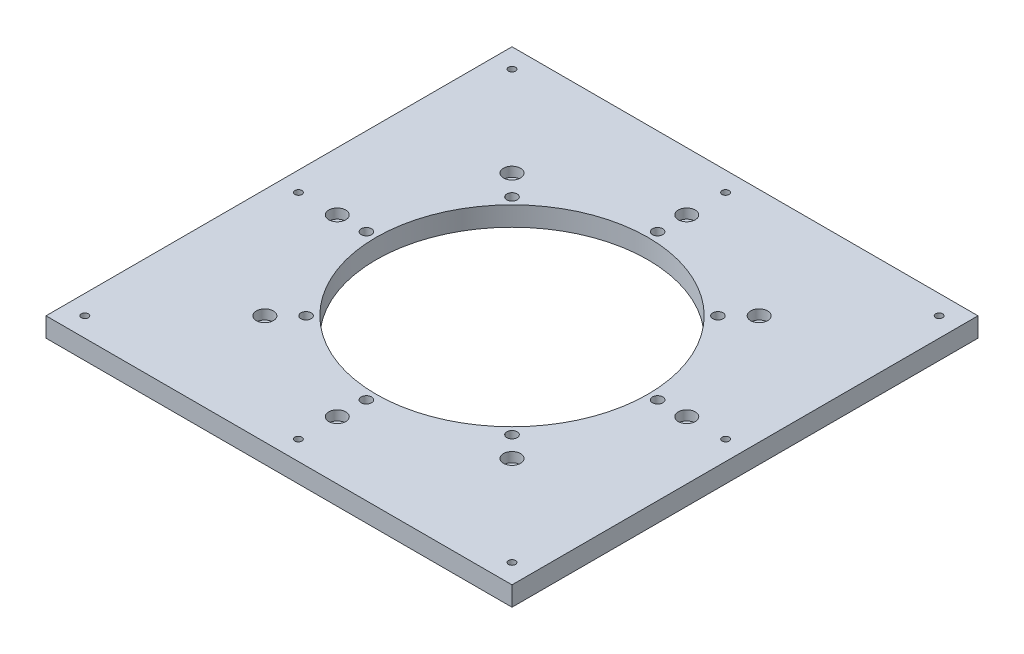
ISO-10303-21;
HEADER;
FILE_DESCRIPTION(('STEP AP214'),'2;1');
FILE_NAME('part.step','',(''),(''),'','','');
FILE_SCHEMA(('AUTOMOTIVE_DESIGN { 1 0 10303 214 1 1 1 1 }'));
ENDSEC;
DATA;
#1=APPLICATION_CONTEXT('core data for automotive mechanical design processes');
#2=APPLICATION_PROTOCOL_DEFINITION('international standard','automotive_design',2000,#1);
#3=PRODUCT_CONTEXT('',#1,'mechanical');
#4=PRODUCT('Part','Part','',(#3));
#5=PRODUCT_RELATED_PRODUCT_CATEGORY('part','',(#4));
#6=PRODUCT_DEFINITION_FORMATION('','',#4);
#7=PRODUCT_DEFINITION_CONTEXT('part definition',#1,'design');
#8=PRODUCT_DEFINITION('design','',#6,#7);
#9=PRODUCT_DEFINITION_SHAPE('','',#8);
#10=(LENGTH_UNIT() NAMED_UNIT(*) SI_UNIT(.MILLI.,.METRE.));
#11=(NAMED_UNIT(*) PLANE_ANGLE_UNIT() SI_UNIT($,.RADIAN.));
#12=(NAMED_UNIT(*) SI_UNIT($,.STERADIAN.) SOLID_ANGLE_UNIT());
#13=UNCERTAINTY_MEASURE_WITH_UNIT(LENGTH_MEASURE(1.E-05),#10,'distance_accuracy_value','');
#14=(GEOMETRIC_REPRESENTATION_CONTEXT(3) GLOBAL_UNCERTAINTY_ASSIGNED_CONTEXT((#13)) GLOBAL_UNIT_ASSIGNED_CONTEXT((#10,
#11,#12)) REPRESENTATION_CONTEXT('',''));
#15=CARTESIAN_POINT('',(0.,0.,0.));
#16=DIRECTION('',(0.,0.,1.));
#17=DIRECTION('',(1.,0.,0.));
#18=AXIS2_PLACEMENT_3D('',#15,#16,#17);
#19=CARTESIAN_POINT('',(0.,12.7,0.));
#20=DIRECTION('',(-1.,0.,0.));
#21=DIRECTION('',(0.,0.,1.));
#22=AXIS2_PLACEMENT_3D('',#19,#20,#21);
#23=PLANE('',#22);
#24=DIRECTION('',(0.,0.,-1.));
#25=VECTOR('',#24,1.);
#26=CARTESIAN_POINT('',(0.,0.,0.));
#27=LINE('',#26,#25);
#28=CARTESIAN_POINT('',(0.,0.,304.8));
#29=VERTEX_POINT('',#28);
#30=CARTESIAN_POINT('',(0.,0.,0.));
#31=VERTEX_POINT('',#30);
#32=EDGE_CURVE('E98',#29,#31,#27,.T.);
#33=ORIENTED_EDGE('',*,*,#32,.T.);
#34=DIRECTION('',(0.,-1.,0.));
#35=VECTOR('',#34,1.);
#36=CARTESIAN_POINT('',(0.,12.7,0.));
#37=LINE('',#36,#35);
#38=CARTESIAN_POINT('',(0.,12.7,0.));
#39=VERTEX_POINT('',#38);
#40=EDGE_CURVE('E11',#39,#31,#37,.T.);
#41=ORIENTED_EDGE('',*,*,#40,.F.);
#42=DIRECTION('',(0.,0.,-1.));
#43=VECTOR('',#42,1.);
#44=CARTESIAN_POINT('',(0.,12.7,0.));
#45=LINE('',#44,#43);
#46=CARTESIAN_POINT('',(0.,12.7,304.8));
#47=VERTEX_POINT('',#46);
#48=EDGE_CURVE('E85',#47,#39,#45,.T.);
#49=ORIENTED_EDGE('',*,*,#48,.F.);
#50=DIRECTION('',(0.,-1.,0.));
#51=VECTOR('',#50,1.);
#52=CARTESIAN_POINT('',(0.,12.7,304.8));
#53=LINE('',#52,#51);
#54=EDGE_CURVE('E94',#47,#29,#53,.T.);
#55=ORIENTED_EDGE('',*,*,#54,.T.);
#56=EDGE_LOOP('',(#33,#41,#49,#55));
#57=FACE_BOUND('',#56,.T.);
#58=ADVANCED_FACE('F32',(#57),#23,.F.);
#59=CARTESIAN_POINT('',(0.,12.7,0.));
#60=DIRECTION('',(0.,0.,1.));
#61=DIRECTION('',(1.,0.,0.));
#62=AXIS2_PLACEMENT_3D('',#59,#60,#61);
#63=PLANE('',#62);
#64=DIRECTION('',(-1.,0.,0.));
#65=VECTOR('',#64,1.);
#66=CARTESIAN_POINT('',(0.,0.,0.));
#67=LINE('',#66,#65);
#68=CARTESIAN_POINT('',(-304.8,0.,0.));
#69=VERTEX_POINT('',#68);
#70=EDGE_CURVE('E89',#31,#69,#67,.T.);
#71=ORIENTED_EDGE('',*,*,#70,.T.);
#72=DIRECTION('',(0.,-1.,0.));
#73=VECTOR('',#72,1.);
#74=CARTESIAN_POINT('',(-304.8,12.7,0.));
#75=LINE('',#74,#73);
#76=CARTESIAN_POINT('',(-304.8,12.7,0.));
#77=VERTEX_POINT('',#76);
#78=EDGE_CURVE('E41',#77,#69,#75,.T.);
#79=ORIENTED_EDGE('',*,*,#78,.F.);
#80=DIRECTION('',(-1.,0.,0.));
#81=VECTOR('',#80,1.);
#82=CARTESIAN_POINT('',(0.,12.7,0.));
#83=LINE('',#82,#81);
#84=EDGE_CURVE('E80',#39,#77,#83,.T.);
#85=ORIENTED_EDGE('',*,*,#84,.F.);
#86=ORIENTED_EDGE('',*,*,#40,.T.);
#87=EDGE_LOOP('',(#71,#79,#85,#86));
#88=FACE_BOUND('',#87,.T.);
#89=ADVANCED_FACE('F88',(#88),#63,.F.);
#90=CARTESIAN_POINT('',(-304.8,12.7,0.));
#91=DIRECTION('',(1.,0.,0.));
#92=DIRECTION('',(0.,0.,-1.));
#93=AXIS2_PLACEMENT_3D('',#90,#91,#92);
#94=PLANE('',#93);
#95=DIRECTION('',(0.,0.,1.));
#96=VECTOR('',#95,1.);
#97=CARTESIAN_POINT('',(-304.8,0.,0.));
#98=LINE('',#97,#96);
#99=CARTESIAN_POINT('',(-304.8,0.,304.8));
#100=VERTEX_POINT('',#99);
#101=EDGE_CURVE('E67',#69,#100,#98,.T.);
#102=ORIENTED_EDGE('',*,*,#101,.T.);
#103=DIRECTION('',(0.,-1.,0.));
#104=VECTOR('',#103,1.);
#105=CARTESIAN_POINT('',(-304.8,12.7,304.8));
#106=LINE('',#105,#104);
#107=CARTESIAN_POINT('',(-304.8,12.7,304.8));
#108=VERTEX_POINT('',#107);
#109=EDGE_CURVE('E90',#108,#100,#106,.T.);
#110=ORIENTED_EDGE('',*,*,#109,.F.);
#111=DIRECTION('',(0.,0.,1.));
#112=VECTOR('',#111,1.);
#113=CARTESIAN_POINT('',(-304.8,12.7,0.));
#114=LINE('',#113,#112);
#115=EDGE_CURVE('E83',#77,#108,#114,.T.);
#116=ORIENTED_EDGE('',*,*,#115,.F.);
#117=ORIENTED_EDGE('',*,*,#78,.T.);
#118=EDGE_LOOP('',(#102,#110,#116,#117));
#119=FACE_BOUND('',#118,.T.);
#120=ADVANCED_FACE('F92',(#119),#94,.F.);
#121=CARTESIAN_POINT('',(0.,12.7,304.8));
#122=DIRECTION('',(0.,0.,-1.));
#123=DIRECTION('',(-1.,0.,0.));
#124=AXIS2_PLACEMENT_3D('',#121,#122,#123);
#125=PLANE('',#124);
#126=DIRECTION('',(1.,0.,0.));
#127=VECTOR('',#126,1.);
#128=CARTESIAN_POINT('',(0.,0.,304.8));
#129=LINE('',#128,#127);
#130=EDGE_CURVE('E73',#100,#29,#129,.T.);
#131=ORIENTED_EDGE('',*,*,#130,.T.);
#132=ORIENTED_EDGE('',*,*,#54,.F.);
#133=DIRECTION('',(1.,0.,0.));
#134=VECTOR('',#133,1.);
#135=CARTESIAN_POINT('',(0.,12.7,304.8));
#136=LINE('',#135,#134);
#137=EDGE_CURVE('E50',#108,#47,#136,.T.);
#138=ORIENTED_EDGE('',*,*,#137,.F.);
#139=ORIENTED_EDGE('',*,*,#109,.T.);
#140=EDGE_LOOP('',(#131,#132,#138,#139));
#141=FACE_BOUND('',#140,.T.);
#142=ADVANCED_FACE('F413',(#141),#125,.F.);
#143=CARTESIAN_POINT('',(0.,12.7,0.));
#144=DIRECTION('',(0.,-1.,0.));
#145=DIRECTION('',(0.,0.,-1.));
#146=AXIS2_PLACEMENT_3D('',#143,#144,#145);
#147=PLANE('',#146);
#148=CARTESIAN_POINT('',(-292.1,12.7,152.4));
#149=DIRECTION('',(0.,-1.,0.));
#150=DIRECTION('',(0.,0.,-1.));
#151=AXIS2_PLACEMENT_3D('',#148,#149,#150);
#152=CIRCLE('',#151,2.27910982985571);
#153=CARTESIAN_POINT('',(-292.1,12.7,150.120890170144));
#154=VERTEX_POINT('',#153);
#155=EDGE_CURVE('E35',#154,#154,#152,.T.);
#156=ORIENTED_EDGE('',*,*,#155,.T.);
#157=EDGE_LOOP('',(#156));
#158=FACE_BOUND('',#157,.T.);
#159=CARTESIAN_POINT('',(-292.1,12.7,12.7));
#160=DIRECTION('',(0.,-1.,0.));
#161=DIRECTION('',(0.,0.,-1.));
#162=AXIS2_PLACEMENT_3D('',#159,#160,#161);
#163=CIRCLE('',#162,2.27910982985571);
#164=CARTESIAN_POINT('',(-292.1,12.7,10.4208901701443));
#165=VERTEX_POINT('',#164);
#166=EDGE_CURVE('E216',#165,#165,#163,.T.);
#167=ORIENTED_EDGE('',*,*,#166,.T.);
#168=EDGE_LOOP('',(#167));
#169=FACE_BOUND('',#168,.T.);
#170=CARTESIAN_POINT('',(-152.4,12.7,12.7));
#171=DIRECTION('',(0.,-1.,0.));
#172=DIRECTION('',(0.,0.,-1.));
#173=AXIS2_PLACEMENT_3D('',#170,#171,#172);
#174=CIRCLE('',#173,2.27910982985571);
#175=CARTESIAN_POINT('',(-152.4,12.7,10.4208901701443));
#176=VERTEX_POINT('',#175);
#177=EDGE_CURVE('E212',#176,#176,#174,.T.);
#178=ORIENTED_EDGE('',*,*,#177,.T.);
#179=EDGE_LOOP('',(#178));
#180=FACE_BOUND('',#179,.T.);
#181=CARTESIAN_POINT('',(-292.1,12.7,292.1));
#182=DIRECTION('',(0.,-1.,0.));
#183=DIRECTION('',(0.,0.,-1.));
#184=AXIS2_PLACEMENT_3D('',#181,#182,#183);
#185=CIRCLE('',#184,2.27910982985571);
#186=CARTESIAN_POINT('',(-292.1,12.7,289.820890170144));
#187=VERTEX_POINT('',#186);
#188=EDGE_CURVE('E207',#187,#187,#185,.T.);
#189=ORIENTED_EDGE('',*,*,#188,.T.);
#190=EDGE_LOOP('',(#189));
#191=FACE_BOUND('',#190,.T.);
#192=CARTESIAN_POINT('',(-152.4,12.7,292.1));
#193=DIRECTION('',(0.,-1.,0.));
#194=DIRECTION('',(0.,0.,-1.));
#195=AXIS2_PLACEMENT_3D('',#192,#193,#194);
#196=CIRCLE('',#195,2.27910982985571);
#197=CARTESIAN_POINT('',(-152.4,12.7,289.820890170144));
#198=VERTEX_POINT('',#197);
#199=EDGE_CURVE('E202',#198,#198,#196,.T.);
#200=ORIENTED_EDGE('',*,*,#199,.T.);
#201=EDGE_LOOP('',(#200));
#202=FACE_BOUND('',#201,.T.);
#203=CARTESIAN_POINT('',(-12.6999999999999,12.7,292.1));
#204=DIRECTION('',(0.,-1.,0.));
#205=DIRECTION('',(0.,0.,-1.));
#206=AXIS2_PLACEMENT_3D('',#203,#204,#205);
#207=CIRCLE('',#206,2.27910982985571);
#208=CARTESIAN_POINT('',(-12.6999999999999,12.7,289.820890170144));
#209=VERTEX_POINT('',#208);
#210=EDGE_CURVE('E197',#209,#209,#207,.T.);
#211=ORIENTED_EDGE('',*,*,#210,.T.);
#212=EDGE_LOOP('',(#211));
#213=FACE_BOUND('',#212,.T.);
#214=CARTESIAN_POINT('',(-12.7,12.7,152.4));
#215=DIRECTION('',(0.,-1.,0.));
#216=DIRECTION('',(0.,0.,-1.));
#217=AXIS2_PLACEMENT_3D('',#214,#215,#216);
#218=CIRCLE('',#217,2.27910982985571);
#219=CARTESIAN_POINT('',(-12.7,12.7,150.120890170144));
#220=VERTEX_POINT('',#219);
#221=EDGE_CURVE('E192',#220,#220,#218,.T.);
#222=ORIENTED_EDGE('',*,*,#221,.T.);
#223=EDGE_LOOP('',(#222));
#224=FACE_BOUND('',#223,.T.);
#225=CARTESIAN_POINT('',(-12.7,12.7,12.7));
#226=DIRECTION('',(0.,-1.,0.));
#227=DIRECTION('',(0.,0.,-1.));
#228=AXIS2_PLACEMENT_3D('',#225,#226,#227);
#229=CIRCLE('',#228,2.27910982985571);
#230=CARTESIAN_POINT('',(-12.7,12.7,10.4208901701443));
#231=VERTEX_POINT('',#230);
#232=EDGE_CURVE('E187',#231,#231,#229,.T.);
#233=ORIENTED_EDGE('',*,*,#232,.T.);
#234=EDGE_LOOP('',(#233));
#235=FACE_BOUND('',#234,.T.);
#236=CARTESIAN_POINT('',(-85.0480790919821,12.7,85.0480790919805));
#237=DIRECTION('',(0.,-1.,0.));
#238=DIRECTION('',(0.,0.,-1.));
#239=AXIS2_PLACEMENT_3D('',#236,#237,#238);
#240=CIRCLE('',#239,3.3782);
#241=CARTESIAN_POINT('',(-85.0480790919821,12.7,81.6698790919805));
#242=VERTEX_POINT('',#241);
#243=EDGE_CURVE('E182',#242,#242,#240,.T.);
#244=ORIENTED_EDGE('',*,*,#243,.T.);
#245=EDGE_LOOP('',(#244));
#246=FACE_BOUND('',#245,.T.);
#247=CARTESIAN_POINT('',(-57.15,12.7,152.399999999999));
#248=DIRECTION('',(0.,-1.,0.));
#249=DIRECTION('',(0.,0.,-1.));
#250=AXIS2_PLACEMENT_3D('',#247,#248,#249);
#251=CIRCLE('',#250,3.37819999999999);
#252=CARTESIAN_POINT('',(-57.15,12.7,149.021799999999));
#253=VERTEX_POINT('',#252);
#254=EDGE_CURVE('E177',#253,#253,#251,.T.);
#255=ORIENTED_EDGE('',*,*,#254,.T.);
#256=EDGE_LOOP('',(#255));
#257=FACE_BOUND('',#256,.T.);
#258=CARTESIAN_POINT('',(-85.0480790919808,12.7,219.751920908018));
#259=DIRECTION('',(0.,-1.,0.));
#260=DIRECTION('',(0.,0.,-1.));
#261=AXIS2_PLACEMENT_3D('',#258,#259,#260);
#262=CIRCLE('',#261,3.3782);
#263=CARTESIAN_POINT('',(-85.0480790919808,12.7,216.373720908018));
#264=VERTEX_POINT('',#263);
#265=EDGE_CURVE('E172',#264,#264,#262,.T.);
#266=ORIENTED_EDGE('',*,*,#265,.T.);
#267=EDGE_LOOP('',(#266));
#268=FACE_BOUND('',#267,.T.);
#269=CARTESIAN_POINT('',(-152.4,12.7,247.65));
#270=DIRECTION('',(0.,-1.,0.));
#271=DIRECTION('',(0.,0.,-1.));
#272=AXIS2_PLACEMENT_3D('',#269,#270,#271);
#273=CIRCLE('',#272,3.3782);
#274=CARTESIAN_POINT('',(-152.4,12.7,244.2718));
#275=VERTEX_POINT('',#274);
#276=EDGE_CURVE('E167',#275,#275,#273,.T.);
#277=ORIENTED_EDGE('',*,*,#276,.T.);
#278=EDGE_LOOP('',(#277));
#279=FACE_BOUND('',#278,.T.);
#280=CARTESIAN_POINT('',(-219.751920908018,12.7,219.751920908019));
#281=DIRECTION('',(0.,-1.,0.));
#282=DIRECTION('',(0.,0.,-1.));
#283=AXIS2_PLACEMENT_3D('',#280,#281,#282);
#284=CIRCLE('',#283,3.3782);
#285=CARTESIAN_POINT('',(-219.751920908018,12.7,216.373720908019));
#286=VERTEX_POINT('',#285);
#287=EDGE_CURVE('E162',#286,#286,#284,.T.);
#288=ORIENTED_EDGE('',*,*,#287,.T.);
#289=EDGE_LOOP('',(#288));
#290=FACE_BOUND('',#289,.T.);
#291=CARTESIAN_POINT('',(-247.65,12.7,152.4));
#292=DIRECTION('',(0.,-1.,0.));
#293=DIRECTION('',(0.,0.,-1.));
#294=AXIS2_PLACEMENT_3D('',#291,#292,#293);
#295=CIRCLE('',#294,3.3782);
#296=CARTESIAN_POINT('',(-247.65,12.7,149.0218));
#297=VERTEX_POINT('',#296);
#298=EDGE_CURVE('E157',#297,#297,#295,.T.);
#299=ORIENTED_EDGE('',*,*,#298,.T.);
#300=EDGE_LOOP('',(#299));
#301=FACE_BOUND('',#300,.T.);
#302=CARTESIAN_POINT('',(-219.751920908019,12.7,85.0480790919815));
#303=DIRECTION('',(0.,-1.,0.));
#304=DIRECTION('',(0.,0.,-1.));
#305=AXIS2_PLACEMENT_3D('',#302,#303,#304);
#306=CIRCLE('',#305,3.3782);
#307=CARTESIAN_POINT('',(-219.751920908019,12.7,81.6698790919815));
#308=VERTEX_POINT('',#307);
#309=EDGE_CURVE('E152',#308,#308,#306,.T.);
#310=ORIENTED_EDGE('',*,*,#309,.T.);
#311=EDGE_LOOP('',(#310));
#312=FACE_BOUND('',#311,.T.);
#313=CARTESIAN_POINT('',(-152.4,12.7,57.15));
#314=DIRECTION('',(0.,-1.,0.));
#315=DIRECTION('',(0.,0.,-1.));
#316=AXIS2_PLACEMENT_3D('',#313,#314,#315);
#317=CIRCLE('',#316,3.3782);
#318=CARTESIAN_POINT('',(-152.4,12.7,53.7718));
#319=VERTEX_POINT('',#318);
#320=EDGE_CURVE('E147',#319,#319,#317,.T.);
#321=ORIENTED_EDGE('',*,*,#320,.T.);
#322=EDGE_LOOP('',(#321));
#323=FACE_BOUND('',#322,.T.);
#324=CARTESIAN_POINT('',(-71.5776949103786,12.7,71.5776949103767));
#325=DIRECTION('',(0.,1.,0.));
#326=DIRECTION('',(0.,0.,1.));
#327=AXIS2_PLACEMENT_3D('',#324,#325,#326);
#328=CIRCLE('',#327,5.55625);
#329=CARTESIAN_POINT('',(-71.5776949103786,12.7,77.1339449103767));
#330=VERTEX_POINT('',#329);
#331=EDGE_CURVE('E150',#330,#330,#328,.T.);
#332=ORIENTED_EDGE('',*,*,#331,.F.);
#333=EDGE_LOOP('',(#332));
#334=FACE_BOUND('',#333,.T.);
#335=CARTESIAN_POINT('',(-38.1,12.7,152.399999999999));
#336=DIRECTION('',(0.,1.,0.));
#337=DIRECTION('',(0.,0.,1.));
#338=AXIS2_PLACEMENT_3D('',#335,#336,#337);
#339=CIRCLE('',#338,5.55625);
#340=CARTESIAN_POINT('',(-38.1,12.7,157.956249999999));
#341=VERTEX_POINT('',#340);
#342=EDGE_CURVE('E145',#341,#341,#339,.T.);
#343=ORIENTED_EDGE('',*,*,#342,.F.);
#344=EDGE_LOOP('',(#343));
#345=FACE_BOUND('',#344,.T.);
#346=CARTESIAN_POINT('',(-71.5776949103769,12.7,233.222305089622));
#347=DIRECTION('',(0.,1.,0.));
#348=DIRECTION('',(0.,0.,1.));
#349=AXIS2_PLACEMENT_3D('',#346,#347,#348);
#350=CIRCLE('',#349,5.55625);
#351=CARTESIAN_POINT('',(-71.5776949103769,12.7,238.778555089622));
#352=VERTEX_POINT('',#351);
#353=EDGE_CURVE('E140',#352,#352,#350,.T.);
#354=ORIENTED_EDGE('',*,*,#353,.F.);
#355=EDGE_LOOP('',(#354));
#356=FACE_BOUND('',#355,.T.);
#357=CARTESIAN_POINT('',(-152.4,12.7,266.7));
#358=DIRECTION('',(0.,1.,0.));
#359=DIRECTION('',(0.,0.,1.));
#360=AXIS2_PLACEMENT_3D('',#357,#358,#359);
#361=CIRCLE('',#360,5.55624999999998);
#362=CARTESIAN_POINT('',(-152.4,12.7,272.25625));
#363=VERTEX_POINT('',#362);
#364=EDGE_CURVE('E135',#363,#363,#361,.T.);
#365=ORIENTED_EDGE('',*,*,#364,.F.);
#366=EDGE_LOOP('',(#365));
#367=FACE_BOUND('',#366,.T.);
#368=CARTESIAN_POINT('',(-233.222305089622,12.7,233.222305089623));
#369=DIRECTION('',(0.,1.,0.));
#370=DIRECTION('',(0.,0.,1.));
#371=AXIS2_PLACEMENT_3D('',#368,#369,#370);
#372=CIRCLE('',#371,5.55624999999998);
#373=CARTESIAN_POINT('',(-233.222305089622,12.7,238.778555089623));
#374=VERTEX_POINT('',#373);
#375=EDGE_CURVE('E130',#374,#374,#372,.T.);
#376=ORIENTED_EDGE('',*,*,#375,.F.);
#377=EDGE_LOOP('',(#376));
#378=FACE_BOUND('',#377,.T.);
#379=CARTESIAN_POINT('',(-266.7,12.7,152.4));
#380=DIRECTION('',(0.,1.,0.));
#381=DIRECTION('',(0.,0.,1.));
#382=AXIS2_PLACEMENT_3D('',#379,#380,#381);
#383=CIRCLE('',#382,5.55624999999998);
#384=CARTESIAN_POINT('',(-266.7,12.7,157.95625));
#385=VERTEX_POINT('',#384);
#386=EDGE_CURVE('E125',#385,#385,#383,.T.);
#387=ORIENTED_EDGE('',*,*,#386,.F.);
#388=EDGE_LOOP('',(#387));
#389=FACE_BOUND('',#388,.T.);
#390=CARTESIAN_POINT('',(-233.222305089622,12.7,71.5776949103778));
#391=DIRECTION('',(0.,1.,0.));
#392=DIRECTION('',(0.,0.,1.));
#393=AXIS2_PLACEMENT_3D('',#390,#391,#392);
#394=CIRCLE('',#393,5.55624999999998);
#395=CARTESIAN_POINT('',(-233.222305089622,12.7,77.1339449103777));
#396=VERTEX_POINT('',#395);
#397=EDGE_CURVE('E120',#396,#396,#394,.T.);
#398=ORIENTED_EDGE('',*,*,#397,.F.);
#399=EDGE_LOOP('',(#398));
#400=FACE_BOUND('',#399,.T.);
#401=CARTESIAN_POINT('',(-152.4,12.7,38.1));
#402=DIRECTION('',(0.,1.,0.));
#403=DIRECTION('',(0.,0.,1.));
#404=AXIS2_PLACEMENT_3D('',#401,#402,#403);
#405=CIRCLE('',#404,5.55624999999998);
#406=CARTESIAN_POINT('',(-152.4,12.7,43.65625));
#407=VERTEX_POINT('',#406);
#408=EDGE_CURVE('E115',#407,#407,#405,.T.);
#409=ORIENTED_EDGE('',*,*,#408,.F.);
#410=EDGE_LOOP('',(#409));
#411=FACE_BOUND('',#410,.T.);
#412=CARTESIAN_POINT('',(-152.4,12.7,152.4));
#413=DIRECTION('',(0.,1.,0.));
#414=DIRECTION('',(0.,0.,1.));
#415=AXIS2_PLACEMENT_3D('',#412,#413,#414);
#416=CIRCLE('',#415,88.9);
#417=CARTESIAN_POINT('',(-152.4,12.7,241.3));
#418=VERTEX_POINT('',#417);
#419=EDGE_CURVE('E110',#418,#418,#416,.T.);
#420=ORIENTED_EDGE('',*,*,#419,.F.);
#421=EDGE_LOOP('',(#420));
#422=FACE_BOUND('',#421,.T.);
#423=ORIENTED_EDGE('',*,*,#48,.T.);
#424=ORIENTED_EDGE('',*,*,#84,.T.);
#425=ORIENTED_EDGE('',*,*,#115,.T.);
#426=ORIENTED_EDGE('',*,*,#137,.T.);
#427=EDGE_LOOP('',(#423,#424,#425,#426));
#428=FACE_BOUND('',#427,.T.);
#429=ADVANCED_FACE('F81',(#158,#169,#180,#191,#202,#213,#224,#235,#246,#257,#268,#279,#290,#301,
#312,#323,#334,#345,#356,#367,#378,#389,#400,#411,#422,#428),#147,.F.);
#430=CARTESIAN_POINT('',(0.,0.,0.));
#431=DIRECTION('',(0.,-1.,0.));
#432=DIRECTION('',(0.,0.,-1.));
#433=AXIS2_PLACEMENT_3D('',#430,#431,#432);
#434=PLANE('',#433);
#435=CARTESIAN_POINT('',(-292.1,0.,152.4));
#436=DIRECTION('',(0.,-1.,0.));
#437=DIRECTION('',(0.,0.,-1.));
#438=AXIS2_PLACEMENT_3D('',#435,#436,#437);
#439=CIRCLE('',#438,5.55624999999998);
#440=CARTESIAN_POINT('',(-292.1,0.,146.84375));
#441=VERTEX_POINT('',#440);
#442=EDGE_CURVE('E1269',#441,#441,#439,.T.);
#443=ORIENTED_EDGE('',*,*,#442,.F.);
#444=EDGE_LOOP('',(#443));
#445=FACE_BOUND('',#444,.T.);
#446=CARTESIAN_POINT('',(-292.1,0.,12.7));
#447=DIRECTION('',(0.,-1.,0.));
#448=DIRECTION('',(0.,0.,-1.));
#449=AXIS2_PLACEMENT_3D('',#446,#447,#448);
#450=CIRCLE('',#449,5.55624999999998);
#451=CARTESIAN_POINT('',(-292.1,0.,7.14375000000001));
#452=VERTEX_POINT('',#451);
#453=EDGE_CURVE('E1279',#452,#452,#450,.T.);
#454=ORIENTED_EDGE('',*,*,#453,.F.);
#455=EDGE_LOOP('',(#454));
#456=FACE_BOUND('',#455,.T.);
#457=CARTESIAN_POINT('',(-152.4,0.,12.7));
#458=DIRECTION('',(0.,-1.,0.));
#459=DIRECTION('',(0.,0.,-1.));
#460=AXIS2_PLACEMENT_3D('',#457,#458,#459);
#461=CIRCLE('',#460,5.55624999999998);
#462=CARTESIAN_POINT('',(-152.4,0.,7.14375000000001));
#463=VERTEX_POINT('',#462);
#464=EDGE_CURVE('E218',#463,#463,#461,.T.);
#465=ORIENTED_EDGE('',*,*,#464,.F.);
#466=EDGE_LOOP('',(#465));
#467=FACE_BOUND('',#466,.T.);
#468=CARTESIAN_POINT('',(-292.1,0.,292.1));
#469=DIRECTION('',(0.,-1.,0.));
#470=DIRECTION('',(0.,0.,-1.));
#471=AXIS2_PLACEMENT_3D('',#468,#469,#470);
#472=CIRCLE('',#471,5.55624999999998);
#473=CARTESIAN_POINT('',(-292.1,0.,286.54375));
#474=VERTEX_POINT('',#473);
#475=EDGE_CURVE('E214',#474,#474,#472,.T.);
#476=ORIENTED_EDGE('',*,*,#475,.F.);
#477=EDGE_LOOP('',(#476));
#478=FACE_BOUND('',#477,.T.);
#479=CARTESIAN_POINT('',(-152.4,0.,292.1));
#480=DIRECTION('',(0.,-1.,0.));
#481=DIRECTION('',(0.,0.,-1.));
#482=AXIS2_PLACEMENT_3D('',#479,#480,#481);
#483=CIRCLE('',#482,5.55624999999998);
#484=CARTESIAN_POINT('',(-152.4,0.,286.54375));
#485=VERTEX_POINT('',#484);
#486=EDGE_CURVE('E210',#485,#485,#483,.T.);
#487=ORIENTED_EDGE('',*,*,#486,.F.);
#488=EDGE_LOOP('',(#487));
#489=FACE_BOUND('',#488,.T.);
#490=CARTESIAN_POINT('',(-12.6999999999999,0.,292.1));
#491=DIRECTION('',(0.,-1.,0.));
#492=DIRECTION('',(0.,0.,-1.));
#493=AXIS2_PLACEMENT_3D('',#490,#491,#492);
#494=CIRCLE('',#493,5.55625);
#495=CARTESIAN_POINT('',(-12.6999999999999,0.,286.54375));
#496=VERTEX_POINT('',#495);
#497=EDGE_CURVE('E205',#496,#496,#494,.T.);
#498=ORIENTED_EDGE('',*,*,#497,.F.);
#499=EDGE_LOOP('',(#498));
#500=FACE_BOUND('',#499,.T.);
#501=CARTESIAN_POINT('',(-12.7,0.,152.4));
#502=DIRECTION('',(0.,-1.,0.));
#503=DIRECTION('',(0.,0.,-1.));
#504=AXIS2_PLACEMENT_3D('',#501,#502,#503);
#505=CIRCLE('',#504,5.55625);
#506=CARTESIAN_POINT('',(-12.7,0.,146.84375));
#507=VERTEX_POINT('',#506);
#508=EDGE_CURVE('E200',#507,#507,#505,.T.);
#509=ORIENTED_EDGE('',*,*,#508,.F.);
#510=EDGE_LOOP('',(#509));
#511=FACE_BOUND('',#510,.T.);
#512=CARTESIAN_POINT('',(-12.7,0.,12.7));
#513=DIRECTION('',(0.,-1.,0.));
#514=DIRECTION('',(0.,0.,-1.));
#515=AXIS2_PLACEMENT_3D('',#512,#513,#514);
#516=CIRCLE('',#515,5.55625);
#517=CARTESIAN_POINT('',(-12.7,0.,7.14375));
#518=VERTEX_POINT('',#517);
#519=EDGE_CURVE('E195',#518,#518,#516,.T.);
#520=ORIENTED_EDGE('',*,*,#519,.F.);
#521=EDGE_LOOP('',(#520));
#522=FACE_BOUND('',#521,.T.);
#523=CARTESIAN_POINT('',(-85.0480790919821,0.,85.0480790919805));
#524=DIRECTION('',(0.,-1.,0.));
#525=DIRECTION('',(0.,0.,-1.));
#526=AXIS2_PLACEMENT_3D('',#523,#524,#525);
#527=CIRCLE('',#526,5.55625);
#528=CARTESIAN_POINT('',(-85.0480790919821,0.,79.4918290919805));
#529=VERTEX_POINT('',#528);
#530=EDGE_CURVE('E190',#529,#529,#527,.T.);
#531=ORIENTED_EDGE('',*,*,#530,.F.);
#532=EDGE_LOOP('',(#531));
#533=FACE_BOUND('',#532,.T.);
#534=CARTESIAN_POINT('',(-57.15,0.,152.399999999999));
#535=DIRECTION('',(0.,-1.,0.));
#536=DIRECTION('',(0.,0.,-1.));
#537=AXIS2_PLACEMENT_3D('',#534,#535,#536);
#538=CIRCLE('',#537,5.55625);
#539=CARTESIAN_POINT('',(-57.15,0.,146.843749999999));
#540=VERTEX_POINT('',#539);
#541=EDGE_CURVE('E185',#540,#540,#538,.T.);
#542=ORIENTED_EDGE('',*,*,#541,.F.);
#543=EDGE_LOOP('',(#542));
#544=FACE_BOUND('',#543,.T.);
#545=CARTESIAN_POINT('',(-85.0480790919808,0.,219.751920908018));
#546=DIRECTION('',(0.,-1.,0.));
#547=DIRECTION('',(0.,0.,-1.));
#548=AXIS2_PLACEMENT_3D('',#545,#546,#547);
#549=CIRCLE('',#548,5.55625);
#550=CARTESIAN_POINT('',(-85.0480790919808,0.,214.195670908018));
#551=VERTEX_POINT('',#550);
#552=EDGE_CURVE('E180',#551,#551,#549,.T.);
#553=ORIENTED_EDGE('',*,*,#552,.F.);
#554=EDGE_LOOP('',(#553));
#555=FACE_BOUND('',#554,.T.);
#556=CARTESIAN_POINT('',(-152.4,0.,247.65));
#557=DIRECTION('',(0.,-1.,0.));
#558=DIRECTION('',(0.,0.,-1.));
#559=AXIS2_PLACEMENT_3D('',#556,#557,#558);
#560=CIRCLE('',#559,5.55625000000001);
#561=CARTESIAN_POINT('',(-152.4,0.,242.09375));
#562=VERTEX_POINT('',#561);
#563=EDGE_CURVE('E175',#562,#562,#560,.T.);
#564=ORIENTED_EDGE('',*,*,#563,.F.);
#565=EDGE_LOOP('',(#564));
#566=FACE_BOUND('',#565,.T.);
#567=CARTESIAN_POINT('',(-219.751920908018,0.,219.751920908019));
#568=DIRECTION('',(0.,-1.,0.));
#569=DIRECTION('',(0.,0.,-1.));
#570=AXIS2_PLACEMENT_3D('',#567,#568,#569);
#571=CIRCLE('',#570,5.55625000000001);
#572=CARTESIAN_POINT('',(-219.751920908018,0.,214.195670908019));
#573=VERTEX_POINT('',#572);
#574=EDGE_CURVE('E170',#573,#573,#571,.T.);
#575=ORIENTED_EDGE('',*,*,#574,.F.);
#576=EDGE_LOOP('',(#575));
#577=FACE_BOUND('',#576,.T.);
#578=CARTESIAN_POINT('',(-247.65,0.,152.4));
#579=DIRECTION('',(0.,-1.,0.));
#580=DIRECTION('',(0.,0.,-1.));
#581=AXIS2_PLACEMENT_3D('',#578,#579,#580);
#582=CIRCLE('',#581,5.55625000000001);
#583=CARTESIAN_POINT('',(-247.65,0.,146.84375));
#584=VERTEX_POINT('',#583);
#585=EDGE_CURVE('E165',#584,#584,#582,.T.);
#586=ORIENTED_EDGE('',*,*,#585,.F.);
#587=EDGE_LOOP('',(#586));
#588=FACE_BOUND('',#587,.T.);
#589=CARTESIAN_POINT('',(-219.751920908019,0.,85.0480790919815));
#590=DIRECTION('',(0.,-1.,0.));
#591=DIRECTION('',(0.,0.,-1.));
#592=AXIS2_PLACEMENT_3D('',#589,#590,#591);
#593=CIRCLE('',#592,5.55625000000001);
#594=CARTESIAN_POINT('',(-219.751920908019,0.,79.4918290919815));
#595=VERTEX_POINT('',#594);
#596=EDGE_CURVE('E160',#595,#595,#593,.T.);
#597=ORIENTED_EDGE('',*,*,#596,.F.);
#598=EDGE_LOOP('',(#597));
#599=FACE_BOUND('',#598,.T.);
#600=CARTESIAN_POINT('',(-152.4,0.,57.15));
#601=DIRECTION('',(0.,-1.,0.));
#602=DIRECTION('',(0.,0.,-1.));
#603=AXIS2_PLACEMENT_3D('',#600,#601,#602);
#604=CIRCLE('',#603,5.55625000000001);
#605=CARTESIAN_POINT('',(-152.4,0.,51.59375));
#606=VERTEX_POINT('',#605);
#607=EDGE_CURVE('E155',#606,#606,#604,.T.);
#608=ORIENTED_EDGE('',*,*,#607,.F.);
#609=EDGE_LOOP('',(#608));
#610=FACE_BOUND('',#609,.T.);
#611=CARTESIAN_POINT('',(-71.5776949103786,0.,71.5776949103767));
#612=DIRECTION('',(0.,-1.,0.));
#613=DIRECTION('',(0.,0.,-1.));
#614=AXIS2_PLACEMENT_3D('',#611,#612,#613);
#615=CIRCLE('',#614,3.3782);
#616=CARTESIAN_POINT('',(-71.5776949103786,0.,68.1994949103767));
#617=VERTEX_POINT('',#616);
#618=EDGE_CURVE('E142',#617,#617,#615,.T.);
#619=ORIENTED_EDGE('',*,*,#618,.F.);
#620=EDGE_LOOP('',(#619));
#621=FACE_BOUND('',#620,.T.);
#622=CARTESIAN_POINT('',(-38.1,0.,152.399999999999));
#623=DIRECTION('',(0.,-1.,0.));
#624=DIRECTION('',(0.,0.,-1.));
#625=AXIS2_PLACEMENT_3D('',#622,#623,#624);
#626=CIRCLE('',#625,3.3782);
#627=CARTESIAN_POINT('',(-38.1,0.,149.021799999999));
#628=VERTEX_POINT('',#627);
#629=EDGE_CURVE('E137',#628,#628,#626,.T.);
#630=ORIENTED_EDGE('',*,*,#629,.F.);
#631=EDGE_LOOP('',(#630));
#632=FACE_BOUND('',#631,.T.);
#633=CARTESIAN_POINT('',(-71.5776949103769,0.,233.222305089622));
#634=DIRECTION('',(0.,-1.,0.));
#635=DIRECTION('',(0.,0.,-1.));
#636=AXIS2_PLACEMENT_3D('',#633,#634,#635);
#637=CIRCLE('',#636,3.3782);
#638=CARTESIAN_POINT('',(-71.5776949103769,0.,229.844105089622));
#639=VERTEX_POINT('',#638);
#640=EDGE_CURVE('E132',#639,#639,#637,.T.);
#641=ORIENTED_EDGE('',*,*,#640,.F.);
#642=EDGE_LOOP('',(#641));
#643=FACE_BOUND('',#642,.T.);
#644=CARTESIAN_POINT('',(-152.4,0.,266.7));
#645=DIRECTION('',(0.,-1.,0.));
#646=DIRECTION('',(0.,0.,-1.));
#647=AXIS2_PLACEMENT_3D('',#644,#645,#646);
#648=CIRCLE('',#647,3.3782);
#649=CARTESIAN_POINT('',(-152.4,0.,263.3218));
#650=VERTEX_POINT('',#649);
#651=EDGE_CURVE('E127',#650,#650,#648,.T.);
#652=ORIENTED_EDGE('',*,*,#651,.F.);
#653=EDGE_LOOP('',(#652));
#654=FACE_BOUND('',#653,.T.);
#655=CARTESIAN_POINT('',(-233.222305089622,0.,233.222305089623));
#656=DIRECTION('',(0.,-1.,0.));
#657=DIRECTION('',(0.,0.,-1.));
#658=AXIS2_PLACEMENT_3D('',#655,#656,#657);
#659=CIRCLE('',#658,3.3782);
#660=CARTESIAN_POINT('',(-233.222305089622,0.,229.844105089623));
#661=VERTEX_POINT('',#660);
#662=EDGE_CURVE('E122',#661,#661,#659,.T.);
#663=ORIENTED_EDGE('',*,*,#662,.F.);
#664=EDGE_LOOP('',(#663));
#665=FACE_BOUND('',#664,.T.);
#666=CARTESIAN_POINT('',(-266.7,0.,152.4));
#667=DIRECTION('',(0.,-1.,0.));
#668=DIRECTION('',(0.,0.,-1.));
#669=AXIS2_PLACEMENT_3D('',#666,#667,#668);
#670=CIRCLE('',#669,3.3782);
#671=CARTESIAN_POINT('',(-266.7,0.,149.0218));
#672=VERTEX_POINT('',#671);
#673=EDGE_CURVE('E117',#672,#672,#670,.T.);
#674=ORIENTED_EDGE('',*,*,#673,.F.);
#675=EDGE_LOOP('',(#674));
#676=FACE_BOUND('',#675,.T.);
#677=CARTESIAN_POINT('',(-233.222305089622,0.,71.5776949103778));
#678=DIRECTION('',(0.,-1.,0.));
#679=DIRECTION('',(0.,0.,-1.));
#680=AXIS2_PLACEMENT_3D('',#677,#678,#679);
#681=CIRCLE('',#680,3.3782);
#682=CARTESIAN_POINT('',(-233.222305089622,0.,68.1994949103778));
#683=VERTEX_POINT('',#682);
#684=EDGE_CURVE('E112',#683,#683,#681,.T.);
#685=ORIENTED_EDGE('',*,*,#684,.F.);
#686=EDGE_LOOP('',(#685));
#687=FACE_BOUND('',#686,.T.);
#688=CARTESIAN_POINT('',(-152.4,0.,38.1));
#689=DIRECTION('',(0.,-1.,0.));
#690=DIRECTION('',(0.,0.,-1.));
#691=AXIS2_PLACEMENT_3D('',#688,#689,#690);
#692=CIRCLE('',#691,3.3782);
#693=CARTESIAN_POINT('',(-152.4,0.,34.7218));
#694=VERTEX_POINT('',#693);
#695=EDGE_CURVE('E107',#694,#694,#692,.T.);
#696=ORIENTED_EDGE('',*,*,#695,.F.);
#697=EDGE_LOOP('',(#696));
#698=FACE_BOUND('',#697,.T.);
#699=CARTESIAN_POINT('',(-152.4,0.,152.4));
#700=DIRECTION('',(0.,1.,0.));
#701=DIRECTION('',(0.,0.,1.));
#702=AXIS2_PLACEMENT_3D('',#699,#700,#701);
#703=CIRCLE('',#702,88.9);
#704=CARTESIAN_POINT('',(-152.4,0.,241.3));
#705=VERTEX_POINT('',#704);
#706=EDGE_CURVE('E101',#705,#705,#703,.T.);
#707=ORIENTED_EDGE('',*,*,#706,.T.);
#708=EDGE_LOOP('',(#707));
#709=FACE_BOUND('',#708,.T.);
#710=ORIENTED_EDGE('',*,*,#32,.F.);
#711=ORIENTED_EDGE('',*,*,#130,.F.);
#712=ORIENTED_EDGE('',*,*,#101,.F.);
#713=ORIENTED_EDGE('',*,*,#70,.F.);
#714=EDGE_LOOP('',(#710,#711,#712,#713));
#715=FACE_BOUND('',#714,.T.);
#716=ADVANCED_FACE('F412',(#445,#456,#467,#478,#489,#500,#511,#522,#533,#544,#555,#566,#577,
#588,#599,#610,#621,#632,#643,#654,#665,#676,#687,#698,#709,#715),#434,.T.);
#717=CARTESIAN_POINT('',(-152.4,0.,152.4));
#718=DIRECTION('',(0.,1.,0.));
#719=DIRECTION('',(0.,0.,1.));
#720=AXIS2_PLACEMENT_3D('',#717,#718,#719);
#721=CYLINDRICAL_SURFACE('',#720,88.9);
#722=ORIENTED_EDGE('',*,*,#706,.F.);
#723=EDGE_LOOP('',(#722));
#724=FACE_BOUND('',#723,.T.);
#725=ORIENTED_EDGE('',*,*,#419,.T.);
#726=EDGE_LOOP('',(#725));
#727=FACE_BOUND('',#726,.T.);
#728=ADVANCED_FACE('F409',(#724,#727),#721,.F.);
#729=CARTESIAN_POINT('',(-152.4,12.7,38.1));
#730=DIRECTION('',(0.,1.,0.));
#731=DIRECTION('',(0.,0.,1.));
#732=AXIS2_PLACEMENT_3D('',#729,#730,#731);
#733=CYLINDRICAL_SURFACE('',#732,3.3782);
#734=ORIENTED_EDGE('',*,*,#695,.T.);
#735=EDGE_LOOP('',(#734));
#736=FACE_BOUND('',#735,.T.);
#737=CARTESIAN_POINT('',(-152.4,6.35,38.1));
#738=DIRECTION('',(0.,1.,0.));
#739=DIRECTION('',(0.,0.,1.));
#740=AXIS2_PLACEMENT_3D('',#737,#738,#739);
#741=CIRCLE('',#740,3.3782);
#742=CARTESIAN_POINT('',(-152.4,6.35,41.4782));
#743=VERTEX_POINT('',#742);
#744=EDGE_CURVE('E111',#743,#743,#741,.T.);
#745=ORIENTED_EDGE('',*,*,#744,.T.);
#746=EDGE_LOOP('',(#745));
#747=FACE_BOUND('',#746,.T.);
#748=ADVANCED_FACE('F452',(#736,#747),#733,.F.);
#749=CARTESIAN_POINT('',(-149.0218,6.35,38.1));
#750=DIRECTION('',(0.,-1.,0.));
#751=DIRECTION('',(0.,0.,-1.));
#752=AXIS2_PLACEMENT_3D('',#749,#750,#751);
#753=PLANE('',#752);
#754=ORIENTED_EDGE('',*,*,#744,.F.);
#755=EDGE_LOOP('',(#754));
#756=FACE_BOUND('',#755,.T.);
#757=CARTESIAN_POINT('',(-152.4,6.35,38.1));
#758=DIRECTION('',(0.,1.,0.));
#759=DIRECTION('',(0.,0.,1.));
#760=AXIS2_PLACEMENT_3D('',#757,#758,#759);
#761=CIRCLE('',#760,5.55624999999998);
#762=CARTESIAN_POINT('',(-152.4,6.35,43.65625));
#763=VERTEX_POINT('',#762);
#764=EDGE_CURVE('E399',#763,#763,#761,.T.);
#765=ORIENTED_EDGE('',*,*,#764,.T.);
#766=EDGE_LOOP('',(#765));
#767=FACE_BOUND('',#766,.T.);
#768=ADVANCED_FACE('F462',(#756,#767),#753,.F.);
#769=CARTESIAN_POINT('',(-152.4,12.7,38.1));
#770=DIRECTION('',(0.,1.,0.));
#771=DIRECTION('',(0.,0.,1.));
#772=AXIS2_PLACEMENT_3D('',#769,#770,#771);
#773=CYLINDRICAL_SURFACE('',#772,5.55624999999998);
#774=ORIENTED_EDGE('',*,*,#764,.F.);
#775=EDGE_LOOP('',(#774));
#776=FACE_BOUND('',#775,.T.);
#777=ORIENTED_EDGE('',*,*,#408,.T.);
#778=EDGE_LOOP('',(#777));
#779=FACE_BOUND('',#778,.T.);
#780=ADVANCED_FACE('F472',(#776,#779),#773,.F.);
#781=CARTESIAN_POINT('',(-233.222305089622,12.7,71.5776949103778));
#782=DIRECTION('',(0.,1.,0.));
#783=DIRECTION('',(0.,0.,1.));
#784=AXIS2_PLACEMENT_3D('',#781,#782,#783);
#785=CYLINDRICAL_SURFACE('',#784,3.3782);
#786=ORIENTED_EDGE('',*,*,#684,.T.);
#787=EDGE_LOOP('',(#786));
#788=FACE_BOUND('',#787,.T.);
#789=CARTESIAN_POINT('',(-233.222305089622,6.35,71.5776949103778));
#790=DIRECTION('',(0.,1.,0.));
#791=DIRECTION('',(0.,0.,1.));
#792=AXIS2_PLACEMENT_3D('',#789,#790,#791);
#793=CIRCLE('',#792,3.3782);
#794=CARTESIAN_POINT('',(-233.222305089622,6.35,74.9558949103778));
#795=VERTEX_POINT('',#794);
#796=EDGE_CURVE('E116',#795,#795,#793,.T.);
#797=ORIENTED_EDGE('',*,*,#796,.T.);
#798=EDGE_LOOP('',(#797));
#799=FACE_BOUND('',#798,.T.);
#800=ADVANCED_FACE('F482',(#788,#799),#785,.F.);
#801=CARTESIAN_POINT('',(-229.844105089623,6.35,71.5776949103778));
#802=DIRECTION('',(0.,-1.,0.));
#803=DIRECTION('',(0.,0.,-1.));
#804=AXIS2_PLACEMENT_3D('',#801,#802,#803);
#805=PLANE('',#804);
#806=ORIENTED_EDGE('',*,*,#796,.F.);
#807=EDGE_LOOP('',(#806));
#808=FACE_BOUND('',#807,.T.);
#809=CARTESIAN_POINT('',(-233.222305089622,6.35,71.5776949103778));
#810=DIRECTION('',(0.,1.,0.));
#811=DIRECTION('',(0.,0.,1.));
#812=AXIS2_PLACEMENT_3D('',#809,#810,#811);
#813=CIRCLE('',#812,5.55624999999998);
#814=CARTESIAN_POINT('',(-233.222305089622,6.35,77.1339449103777));
#815=VERTEX_POINT('',#814);
#816=EDGE_CURVE('E392',#815,#815,#813,.T.);
#817=ORIENTED_EDGE('',*,*,#816,.T.);
#818=EDGE_LOOP('',(#817));
#819=FACE_BOUND('',#818,.T.);
#820=ADVANCED_FACE('F492',(#808,#819),#805,.F.);
#821=CARTESIAN_POINT('',(-233.222305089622,12.7,71.5776949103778));
#822=DIRECTION('',(0.,1.,0.));
#823=DIRECTION('',(0.,0.,1.));
#824=AXIS2_PLACEMENT_3D('',#821,#822,#823);
#825=CYLINDRICAL_SURFACE('',#824,5.55624999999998);
#826=ORIENTED_EDGE('',*,*,#816,.F.);
#827=EDGE_LOOP('',(#826));
#828=FACE_BOUND('',#827,.T.);
#829=ORIENTED_EDGE('',*,*,#397,.T.);
#830=EDGE_LOOP('',(#829));
#831=FACE_BOUND('',#830,.T.);
#832=ADVANCED_FACE('F502',(#828,#831),#825,.F.);
#833=CARTESIAN_POINT('',(-266.7,12.7,152.4));
#834=DIRECTION('',(0.,1.,0.));
#835=DIRECTION('',(0.,0.,1.));
#836=AXIS2_PLACEMENT_3D('',#833,#834,#835);
#837=CYLINDRICAL_SURFACE('',#836,3.3782);
#838=ORIENTED_EDGE('',*,*,#673,.T.);
#839=EDGE_LOOP('',(#838));
#840=FACE_BOUND('',#839,.T.);
#841=CARTESIAN_POINT('',(-266.7,6.35,152.4));
#842=DIRECTION('',(0.,1.,0.));
#843=DIRECTION('',(0.,0.,1.));
#844=AXIS2_PLACEMENT_3D('',#841,#842,#843);
#845=CIRCLE('',#844,3.3782);
#846=CARTESIAN_POINT('',(-266.7,6.35,155.7782));
#847=VERTEX_POINT('',#846);
#848=EDGE_CURVE('E121',#847,#847,#845,.T.);
#849=ORIENTED_EDGE('',*,*,#848,.T.);
#850=EDGE_LOOP('',(#849));
#851=FACE_BOUND('',#850,.T.);
#852=ADVANCED_FACE('F512',(#840,#851),#837,.F.);
#853=CARTESIAN_POINT('',(-263.3218,6.35,152.4));
#854=DIRECTION('',(0.,-1.,0.));
#855=DIRECTION('',(0.,0.,-1.));
#856=AXIS2_PLACEMENT_3D('',#853,#854,#855);
#857=PLANE('',#856);
#858=ORIENTED_EDGE('',*,*,#848,.F.);
#859=EDGE_LOOP('',(#858));
#860=FACE_BOUND('',#859,.T.);
#861=CARTESIAN_POINT('',(-266.7,6.35,152.4));
#862=DIRECTION('',(0.,1.,0.));
#863=DIRECTION('',(0.,0.,1.));
#864=AXIS2_PLACEMENT_3D('',#861,#862,#863);
#865=CIRCLE('',#864,5.55624999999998);
#866=CARTESIAN_POINT('',(-266.7,6.35,157.95625));
#867=VERTEX_POINT('',#866);
#868=EDGE_CURVE('E385',#867,#867,#865,.T.);
#869=ORIENTED_EDGE('',*,*,#868,.T.);
#870=EDGE_LOOP('',(#869));
#871=FACE_BOUND('',#870,.T.);
#872=ADVANCED_FACE('F522',(#860,#871),#857,.F.);
#873=CARTESIAN_POINT('',(-266.7,12.7,152.4));
#874=DIRECTION('',(0.,1.,0.));
#875=DIRECTION('',(0.,0.,1.));
#876=AXIS2_PLACEMENT_3D('',#873,#874,#875);
#877=CYLINDRICAL_SURFACE('',#876,5.55624999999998);
#878=ORIENTED_EDGE('',*,*,#868,.F.);
#879=EDGE_LOOP('',(#878));
#880=FACE_BOUND('',#879,.T.);
#881=ORIENTED_EDGE('',*,*,#386,.T.);
#882=EDGE_LOOP('',(#881));
#883=FACE_BOUND('',#882,.T.);
#884=ADVANCED_FACE('F532',(#880,#883),#877,.F.);
#885=CARTESIAN_POINT('',(-233.222305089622,12.7,233.222305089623));
#886=DIRECTION('',(0.,1.,0.));
#887=DIRECTION('',(0.,0.,1.));
#888=AXIS2_PLACEMENT_3D('',#885,#886,#887);
#889=CYLINDRICAL_SURFACE('',#888,3.3782);
#890=ORIENTED_EDGE('',*,*,#662,.T.);
#891=EDGE_LOOP('',(#890));
#892=FACE_BOUND('',#891,.T.);
#893=CARTESIAN_POINT('',(-233.222305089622,6.35,233.222305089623));
#894=DIRECTION('',(0.,1.,0.));
#895=DIRECTION('',(0.,0.,1.));
#896=AXIS2_PLACEMENT_3D('',#893,#894,#895);
#897=CIRCLE('',#896,3.3782);
#898=CARTESIAN_POINT('',(-233.222305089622,6.35,236.600505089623));
#899=VERTEX_POINT('',#898);
#900=EDGE_CURVE('E126',#899,#899,#897,.T.);
#901=ORIENTED_EDGE('',*,*,#900,.T.);
#902=EDGE_LOOP('',(#901));
#903=FACE_BOUND('',#902,.T.);
#904=ADVANCED_FACE('F542',(#892,#903),#889,.F.);
#905=CARTESIAN_POINT('',(-229.844105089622,6.35,233.222305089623));
#906=DIRECTION('',(0.,-1.,0.));
#907=DIRECTION('',(0.,0.,-1.));
#908=AXIS2_PLACEMENT_3D('',#905,#906,#907);
#909=PLANE('',#908);
#910=ORIENTED_EDGE('',*,*,#900,.F.);
#911=EDGE_LOOP('',(#910));
#912=FACE_BOUND('',#911,.T.);
#913=CARTESIAN_POINT('',(-233.222305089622,6.35,233.222305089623));
#914=DIRECTION('',(0.,1.,0.));
#915=DIRECTION('',(0.,0.,1.));
#916=AXIS2_PLACEMENT_3D('',#913,#914,#915);
#917=CIRCLE('',#916,5.55624999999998);
#918=CARTESIAN_POINT('',(-233.222305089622,6.35,238.778555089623));
#919=VERTEX_POINT('',#918);
#920=EDGE_CURVE('E378',#919,#919,#917,.T.);
#921=ORIENTED_EDGE('',*,*,#920,.T.);
#922=EDGE_LOOP('',(#921));
#923=FACE_BOUND('',#922,.T.);
#924=ADVANCED_FACE('F552',(#912,#923),#909,.F.);
#925=CARTESIAN_POINT('',(-233.222305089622,12.7,233.222305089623));
#926=DIRECTION('',(0.,1.,0.));
#927=DIRECTION('',(0.,0.,1.));
#928=AXIS2_PLACEMENT_3D('',#925,#926,#927);
#929=CYLINDRICAL_SURFACE('',#928,5.55624999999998);
#930=ORIENTED_EDGE('',*,*,#920,.F.);
#931=EDGE_LOOP('',(#930));
#932=FACE_BOUND('',#931,.T.);
#933=ORIENTED_EDGE('',*,*,#375,.T.);
#934=EDGE_LOOP('',(#933));
#935=FACE_BOUND('',#934,.T.);
#936=ADVANCED_FACE('F562',(#932,#935),#929,.F.);
#937=CARTESIAN_POINT('',(-152.4,12.7,266.7));
#938=DIRECTION('',(0.,1.,0.));
#939=DIRECTION('',(0.,0.,1.));
#940=AXIS2_PLACEMENT_3D('',#937,#938,#939);
#941=CYLINDRICAL_SURFACE('',#940,3.3782);
#942=ORIENTED_EDGE('',*,*,#651,.T.);
#943=EDGE_LOOP('',(#942));
#944=FACE_BOUND('',#943,.T.);
#945=CARTESIAN_POINT('',(-152.4,6.35,266.7));
#946=DIRECTION('',(0.,1.,0.));
#947=DIRECTION('',(0.,0.,1.));
#948=AXIS2_PLACEMENT_3D('',#945,#946,#947);
#949=CIRCLE('',#948,3.3782);
#950=CARTESIAN_POINT('',(-152.4,6.35,270.0782));
#951=VERTEX_POINT('',#950);
#952=EDGE_CURVE('E131',#951,#951,#949,.T.);
#953=ORIENTED_EDGE('',*,*,#952,.T.);
#954=EDGE_LOOP('',(#953));
#955=FACE_BOUND('',#954,.T.);
#956=ADVANCED_FACE('F572',(#944,#955),#941,.F.);
#957=CARTESIAN_POINT('',(-149.0218,6.35,266.7));
#958=DIRECTION('',(0.,-1.,0.));
#959=DIRECTION('',(0.,0.,-1.));
#960=AXIS2_PLACEMENT_3D('',#957,#958,#959);
#961=PLANE('',#960);
#962=ORIENTED_EDGE('',*,*,#952,.F.);
#963=EDGE_LOOP('',(#962));
#964=FACE_BOUND('',#963,.T.);
#965=CARTESIAN_POINT('',(-152.4,6.35,266.7));
#966=DIRECTION('',(0.,1.,0.));
#967=DIRECTION('',(0.,0.,1.));
#968=AXIS2_PLACEMENT_3D('',#965,#966,#967);
#969=CIRCLE('',#968,5.55624999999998);
#970=CARTESIAN_POINT('',(-152.4,6.35,272.25625));
#971=VERTEX_POINT('',#970);
#972=EDGE_CURVE('E371',#971,#971,#969,.T.);
#973=ORIENTED_EDGE('',*,*,#972,.T.);
#974=EDGE_LOOP('',(#973));
#975=FACE_BOUND('',#974,.T.);
#976=ADVANCED_FACE('F582',(#964,#975),#961,.F.);
#977=CARTESIAN_POINT('',(-152.4,12.7,266.7));
#978=DIRECTION('',(0.,1.,0.));
#979=DIRECTION('',(0.,0.,1.));
#980=AXIS2_PLACEMENT_3D('',#977,#978,#979);
#981=CYLINDRICAL_SURFACE('',#980,5.55624999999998);
#982=ORIENTED_EDGE('',*,*,#972,.F.);
#983=EDGE_LOOP('',(#982));
#984=FACE_BOUND('',#983,.T.);
#985=ORIENTED_EDGE('',*,*,#364,.T.);
#986=EDGE_LOOP('',(#985));
#987=FACE_BOUND('',#986,.T.);
#988=ADVANCED_FACE('F592',(#984,#987),#981,.F.);
#989=CARTESIAN_POINT('',(-71.5776949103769,12.7,233.222305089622));
#990=DIRECTION('',(0.,1.,0.));
#991=DIRECTION('',(0.,0.,1.));
#992=AXIS2_PLACEMENT_3D('',#989,#990,#991);
#993=CYLINDRICAL_SURFACE('',#992,3.3782);
#994=ORIENTED_EDGE('',*,*,#640,.T.);
#995=EDGE_LOOP('',(#994));
#996=FACE_BOUND('',#995,.T.);
#997=CARTESIAN_POINT('',(-71.5776949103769,6.35,233.222305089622));
#998=DIRECTION('',(0.,1.,0.));
#999=DIRECTION('',(0.,0.,1.));
#1000=AXIS2_PLACEMENT_3D('',#997,#998,#999);
#1001=CIRCLE('',#1000,3.3782);
#1002=CARTESIAN_POINT('',(-71.5776949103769,6.35,236.600505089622));
#1003=VERTEX_POINT('',#1002);
#1004=EDGE_CURVE('E136',#1003,#1003,#1001,.T.);
#1005=ORIENTED_EDGE('',*,*,#1004,.T.);
#1006=EDGE_LOOP('',(#1005));
#1007=FACE_BOUND('',#1006,.T.);
#1008=ADVANCED_FACE('F602',(#996,#1007),#993,.F.);
#1009=CARTESIAN_POINT('',(-68.1994949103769,6.35,233.222305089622));
#1010=DIRECTION('',(0.,-1.,0.));
#1011=DIRECTION('',(0.,0.,-1.));
#1012=AXIS2_PLACEMENT_3D('',#1009,#1010,#1011);
#1013=PLANE('',#1012);
#1014=ORIENTED_EDGE('',*,*,#1004,.F.);
#1015=EDGE_LOOP('',(#1014));
#1016=FACE_BOUND('',#1015,.T.);
#1017=CARTESIAN_POINT('',(-71.5776949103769,6.35,233.222305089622));
#1018=DIRECTION('',(0.,1.,0.));
#1019=DIRECTION('',(0.,0.,1.));
#1020=AXIS2_PLACEMENT_3D('',#1017,#1018,#1019);
#1021=CIRCLE('',#1020,5.55625);
#1022=CARTESIAN_POINT('',(-71.5776949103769,6.35,238.778555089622));
#1023=VERTEX_POINT('',#1022);
#1024=EDGE_CURVE('E364',#1023,#1023,#1021,.T.);
#1025=ORIENTED_EDGE('',*,*,#1024,.T.);
#1026=EDGE_LOOP('',(#1025));
#1027=FACE_BOUND('',#1026,.T.);
#1028=ADVANCED_FACE('F612',(#1016,#1027),#1013,.F.);
#1029=CARTESIAN_POINT('',(-71.5776949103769,12.7,233.222305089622));
#1030=DIRECTION('',(0.,1.,0.));
#1031=DIRECTION('',(0.,0.,1.));
#1032=AXIS2_PLACEMENT_3D('',#1029,#1030,#1031);
#1033=CYLINDRICAL_SURFACE('',#1032,5.55625);
#1034=ORIENTED_EDGE('',*,*,#1024,.F.);
#1035=EDGE_LOOP('',(#1034));
#1036=FACE_BOUND('',#1035,.T.);
#1037=ORIENTED_EDGE('',*,*,#353,.T.);
#1038=EDGE_LOOP('',(#1037));
#1039=FACE_BOUND('',#1038,.T.);
#1040=ADVANCED_FACE('F622',(#1036,#1039),#1033,.F.);
#1041=CARTESIAN_POINT('',(-38.1,12.7,152.399999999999));
#1042=DIRECTION('',(0.,1.,0.));
#1043=DIRECTION('',(0.,0.,1.));
#1044=AXIS2_PLACEMENT_3D('',#1041,#1042,#1043);
#1045=CYLINDRICAL_SURFACE('',#1044,3.3782);
#1046=ORIENTED_EDGE('',*,*,#629,.T.);
#1047=EDGE_LOOP('',(#1046));
#1048=FACE_BOUND('',#1047,.T.);
#1049=CARTESIAN_POINT('',(-38.1,6.35,152.399999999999));
#1050=DIRECTION('',(0.,1.,0.));
#1051=DIRECTION('',(0.,0.,1.));
#1052=AXIS2_PLACEMENT_3D('',#1049,#1050,#1051);
#1053=CIRCLE('',#1052,3.3782);
#1054=CARTESIAN_POINT('',(-38.1,6.35,155.778199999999));
#1055=VERTEX_POINT('',#1054);
#1056=EDGE_CURVE('E141',#1055,#1055,#1053,.T.);
#1057=ORIENTED_EDGE('',*,*,#1056,.T.);
#1058=EDGE_LOOP('',(#1057));
#1059=FACE_BOUND('',#1058,.T.);
#1060=ADVANCED_FACE('F632',(#1048,#1059),#1045,.F.);
#1061=CARTESIAN_POINT('',(-34.7218,6.35,152.399999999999));
#1062=DIRECTION('',(0.,-1.,0.));
#1063=DIRECTION('',(0.,0.,-1.));
#1064=AXIS2_PLACEMENT_3D('',#1061,#1062,#1063);
#1065=PLANE('',#1064);
#1066=ORIENTED_EDGE('',*,*,#1056,.F.);
#1067=EDGE_LOOP('',(#1066));
#1068=FACE_BOUND('',#1067,.T.);
#1069=CARTESIAN_POINT('',(-38.1,6.35,152.399999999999));
#1070=DIRECTION('',(0.,1.,0.));
#1071=DIRECTION('',(0.,0.,1.));
#1072=AXIS2_PLACEMENT_3D('',#1069,#1070,#1071);
#1073=CIRCLE('',#1072,5.55625);
#1074=CARTESIAN_POINT('',(-38.1,6.35,157.956249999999));
#1075=VERTEX_POINT('',#1074);
#1076=EDGE_CURVE('E357',#1075,#1075,#1073,.T.);
#1077=ORIENTED_EDGE('',*,*,#1076,.T.);
#1078=EDGE_LOOP('',(#1077));
#1079=FACE_BOUND('',#1078,.T.);
#1080=ADVANCED_FACE('F642',(#1068,#1079),#1065,.F.);
#1081=CARTESIAN_POINT('',(-38.1,12.7,152.399999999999));
#1082=DIRECTION('',(0.,1.,0.));
#1083=DIRECTION('',(0.,0.,1.));
#1084=AXIS2_PLACEMENT_3D('',#1081,#1082,#1083);
#1085=CYLINDRICAL_SURFACE('',#1084,5.55625);
#1086=ORIENTED_EDGE('',*,*,#1076,.F.);
#1087=EDGE_LOOP('',(#1086));
#1088=FACE_BOUND('',#1087,.T.);
#1089=ORIENTED_EDGE('',*,*,#342,.T.);
#1090=EDGE_LOOP('',(#1089));
#1091=FACE_BOUND('',#1090,.T.);
#1092=ADVANCED_FACE('F652',(#1088,#1091),#1085,.F.);
#1093=CARTESIAN_POINT('',(-71.5776949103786,12.7,71.5776949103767));
#1094=DIRECTION('',(0.,1.,0.));
#1095=DIRECTION('',(0.,0.,1.));
#1096=AXIS2_PLACEMENT_3D('',#1093,#1094,#1095);
#1097=CYLINDRICAL_SURFACE('',#1096,3.3782);
#1098=ORIENTED_EDGE('',*,*,#618,.T.);
#1099=EDGE_LOOP('',(#1098));
#1100=FACE_BOUND('',#1099,.T.);
#1101=CARTESIAN_POINT('',(-71.5776949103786,6.35,71.5776949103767));
#1102=DIRECTION('',(0.,1.,0.));
#1103=DIRECTION('',(0.,0.,1.));
#1104=AXIS2_PLACEMENT_3D('',#1101,#1102,#1103);
#1105=CIRCLE('',#1104,3.3782);
#1106=CARTESIAN_POINT('',(-71.5776949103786,6.35,74.9558949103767));
#1107=VERTEX_POINT('',#1106);
#1108=EDGE_CURVE('E146',#1107,#1107,#1105,.T.);
#1109=ORIENTED_EDGE('',*,*,#1108,.T.);
#1110=EDGE_LOOP('',(#1109));
#1111=FACE_BOUND('',#1110,.T.);
#1112=ADVANCED_FACE('F662',(#1100,#1111),#1097,.F.);
#1113=CARTESIAN_POINT('',(-68.1994949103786,6.35,71.5776949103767));
#1114=DIRECTION('',(0.,-1.,0.));
#1115=DIRECTION('',(0.,0.,-1.));
#1116=AXIS2_PLACEMENT_3D('',#1113,#1114,#1115);
#1117=PLANE('',#1116);
#1118=ORIENTED_EDGE('',*,*,#1108,.F.);
#1119=EDGE_LOOP('',(#1118));
#1120=FACE_BOUND('',#1119,.T.);
#1121=CARTESIAN_POINT('',(-71.5776949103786,6.35,71.5776949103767));
#1122=DIRECTION('',(0.,1.,0.));
#1123=DIRECTION('',(0.,0.,1.));
#1124=AXIS2_PLACEMENT_3D('',#1121,#1122,#1123);
#1125=CIRCLE('',#1124,5.55625);
#1126=CARTESIAN_POINT('',(-71.5776949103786,6.35,77.1339449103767));
#1127=VERTEX_POINT('',#1126);
#1128=EDGE_CURVE('E350',#1127,#1127,#1125,.T.);
#1129=ORIENTED_EDGE('',*,*,#1128,.T.);
#1130=EDGE_LOOP('',(#1129));
#1131=FACE_BOUND('',#1130,.T.);
#1132=ADVANCED_FACE('F672',(#1120,#1131),#1117,.F.);
#1133=CARTESIAN_POINT('',(-71.5776949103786,12.7,71.5776949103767));
#1134=DIRECTION('',(0.,1.,0.));
#1135=DIRECTION('',(0.,0.,1.));
#1136=AXIS2_PLACEMENT_3D('',#1133,#1134,#1135);
#1137=CYLINDRICAL_SURFACE('',#1136,5.55625);
#1138=ORIENTED_EDGE('',*,*,#1128,.F.);
#1139=EDGE_LOOP('',(#1138));
#1140=FACE_BOUND('',#1139,.T.);
#1141=ORIENTED_EDGE('',*,*,#331,.T.);
#1142=EDGE_LOOP('',(#1141));
#1143=FACE_BOUND('',#1142,.T.);
#1144=ADVANCED_FACE('F682',(#1140,#1143),#1137,.F.);
#1145=CARTESIAN_POINT('',(-152.4,0.,57.15));
#1146=DIRECTION('',(0.,-1.,0.));
#1147=DIRECTION('',(0.,0.,-1.));
#1148=AXIS2_PLACEMENT_3D('',#1145,#1146,#1147);
#1149=CYLINDRICAL_SURFACE('',#1148,3.3782);
#1150=CARTESIAN_POINT('',(-152.4,6.35,57.15));
#1151=DIRECTION('',(0.,-1.,0.));
#1152=DIRECTION('',(0.,0.,-1.));
#1153=AXIS2_PLACEMENT_3D('',#1150,#1151,#1152);
#1154=CIRCLE('',#1153,3.3782);
#1155=CARTESIAN_POINT('',(-152.4,6.35,53.7718));
#1156=VERTEX_POINT('',#1155);
#1157=EDGE_CURVE('E151',#1156,#1156,#1154,.T.);
#1158=ORIENTED_EDGE('',*,*,#1157,.T.);
#1159=EDGE_LOOP('',(#1158));
#1160=FACE_BOUND('',#1159,.T.);
#1161=ORIENTED_EDGE('',*,*,#320,.F.);
#1162=EDGE_LOOP('',(#1161));
#1163=FACE_BOUND('',#1162,.T.);
#1164=ADVANCED_FACE('F692',(#1160,#1163),#1149,.F.);
#1165=CARTESIAN_POINT('',(-149.0218,6.35,57.15));
#1166=DIRECTION('',(0.,1.,0.));
#1167=DIRECTION('',(0.,0.,1.));
#1168=AXIS2_PLACEMENT_3D('',#1165,#1166,#1167);
#1169=PLANE('',#1168);
#1170=ORIENTED_EDGE('',*,*,#1157,.F.);
#1171=EDGE_LOOP('',(#1170));
#1172=FACE_BOUND('',#1171,.T.);
#1173=CARTESIAN_POINT('',(-152.4,6.35,57.15));
#1174=DIRECTION('',(0.,-1.,0.));
#1175=DIRECTION('',(0.,0.,-1.));
#1176=AXIS2_PLACEMENT_3D('',#1173,#1174,#1175);
#1177=CIRCLE('',#1176,5.55624999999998);
#1178=CARTESIAN_POINT('',(-152.4,6.35,51.59375));
#1179=VERTEX_POINT('',#1178);
#1180=EDGE_CURVE('E343',#1179,#1179,#1177,.T.);
#1181=ORIENTED_EDGE('',*,*,#1180,.T.);
#1182=EDGE_LOOP('',(#1181));
#1183=FACE_BOUND('',#1182,.T.);
#1184=ADVANCED_FACE('F702',(#1172,#1183),#1169,.F.);
#1185=CARTESIAN_POINT('',(-152.4,0.,57.15));
#1186=DIRECTION('',(0.,-1.,0.));
#1187=DIRECTION('',(0.,0.,-1.));
#1188=AXIS2_PLACEMENT_3D('',#1185,#1186,#1187);
#1189=CYLINDRICAL_SURFACE('',#1188,5.55625);
#1190=ORIENTED_EDGE('',*,*,#1180,.F.);
#1191=EDGE_LOOP('',(#1190));
#1192=FACE_BOUND('',#1191,.T.);
#1193=ORIENTED_EDGE('',*,*,#607,.T.);
#1194=EDGE_LOOP('',(#1193));
#1195=FACE_BOUND('',#1194,.T.);
#1196=ADVANCED_FACE('F712',(#1192,#1195),#1189,.F.);
#1197=CARTESIAN_POINT('',(-219.751920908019,0.,85.0480790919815));
#1198=DIRECTION('',(0.,-1.,0.));
#1199=DIRECTION('',(0.,0.,-1.));
#1200=AXIS2_PLACEMENT_3D('',#1197,#1198,#1199);
#1201=CYLINDRICAL_SURFACE('',#1200,3.3782);
#1202=CARTESIAN_POINT('',(-219.751920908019,6.35,85.0480790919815));
#1203=DIRECTION('',(0.,-1.,0.));
#1204=DIRECTION('',(0.,0.,-1.));
#1205=AXIS2_PLACEMENT_3D('',#1202,#1203,#1204);
#1206=CIRCLE('',#1205,3.3782);
#1207=CARTESIAN_POINT('',(-219.751920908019,6.35,81.6698790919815));
#1208=VERTEX_POINT('',#1207);
#1209=EDGE_CURVE('E156',#1208,#1208,#1206,.T.);
#1210=ORIENTED_EDGE('',*,*,#1209,.T.);
#1211=EDGE_LOOP('',(#1210));
#1212=FACE_BOUND('',#1211,.T.);
#1213=ORIENTED_EDGE('',*,*,#309,.F.);
#1214=EDGE_LOOP('',(#1213));
#1215=FACE_BOUND('',#1214,.T.);
#1216=ADVANCED_FACE('F722',(#1212,#1215),#1201,.F.);
#1217=CARTESIAN_POINT('',(-216.373720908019,6.35,85.0480790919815));
#1218=DIRECTION('',(0.,1.,0.));
#1219=DIRECTION('',(0.,0.,1.));
#1220=AXIS2_PLACEMENT_3D('',#1217,#1218,#1219);
#1221=PLANE('',#1220);
#1222=ORIENTED_EDGE('',*,*,#1209,.F.);
#1223=EDGE_LOOP('',(#1222));
#1224=FACE_BOUND('',#1223,.T.);
#1225=CARTESIAN_POINT('',(-219.751920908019,6.35,85.0480790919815));
#1226=DIRECTION('',(0.,-1.,0.));
#1227=DIRECTION('',(0.,0.,-1.));
#1228=AXIS2_PLACEMENT_3D('',#1225,#1226,#1227);
#1229=CIRCLE('',#1228,5.55624999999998);
#1230=CARTESIAN_POINT('',(-219.751920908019,6.35,79.4918290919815));
#1231=VERTEX_POINT('',#1230);
#1232=EDGE_CURVE('E336',#1231,#1231,#1229,.T.);
#1233=ORIENTED_EDGE('',*,*,#1232,.T.);
#1234=EDGE_LOOP('',(#1233));
#1235=FACE_BOUND('',#1234,.T.);
#1236=ADVANCED_FACE('F732',(#1224,#1235),#1221,.F.);
#1237=CARTESIAN_POINT('',(-219.751920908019,0.,85.0480790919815));
#1238=DIRECTION('',(0.,-1.,0.));
#1239=DIRECTION('',(0.,0.,-1.));
#1240=AXIS2_PLACEMENT_3D('',#1237,#1238,#1239);
#1241=CYLINDRICAL_SURFACE('',#1240,5.55625);
#1242=ORIENTED_EDGE('',*,*,#1232,.F.);
#1243=EDGE_LOOP('',(#1242));
#1244=FACE_BOUND('',#1243,.T.);
#1245=ORIENTED_EDGE('',*,*,#596,.T.);
#1246=EDGE_LOOP('',(#1245));
#1247=FACE_BOUND('',#1246,.T.);
#1248=ADVANCED_FACE('F742',(#1244,#1247),#1241,.F.);
#1249=CARTESIAN_POINT('',(-247.65,0.,152.4));
#1250=DIRECTION('',(0.,-1.,0.));
#1251=DIRECTION('',(0.,0.,-1.));
#1252=AXIS2_PLACEMENT_3D('',#1249,#1250,#1251);
#1253=CYLINDRICAL_SURFACE('',#1252,3.3782);
#1254=CARTESIAN_POINT('',(-247.65,6.35,152.4));
#1255=DIRECTION('',(0.,-1.,0.));
#1256=DIRECTION('',(0.,0.,-1.));
#1257=AXIS2_PLACEMENT_3D('',#1254,#1255,#1256);
#1258=CIRCLE('',#1257,3.3782);
#1259=CARTESIAN_POINT('',(-247.65,6.35,149.0218));
#1260=VERTEX_POINT('',#1259);
#1261=EDGE_CURVE('E161',#1260,#1260,#1258,.T.);
#1262=ORIENTED_EDGE('',*,*,#1261,.T.);
#1263=EDGE_LOOP('',(#1262));
#1264=FACE_BOUND('',#1263,.T.);
#1265=ORIENTED_EDGE('',*,*,#298,.F.);
#1266=EDGE_LOOP('',(#1265));
#1267=FACE_BOUND('',#1266,.T.);
#1268=ADVANCED_FACE('F752',(#1264,#1267),#1253,.F.);
#1269=CARTESIAN_POINT('',(-244.2718,6.35,152.4));
#1270=DIRECTION('',(0.,1.,0.));
#1271=DIRECTION('',(0.,0.,1.));
#1272=AXIS2_PLACEMENT_3D('',#1269,#1270,#1271);
#1273=PLANE('',#1272);
#1274=ORIENTED_EDGE('',*,*,#1261,.F.);
#1275=EDGE_LOOP('',(#1274));
#1276=FACE_BOUND('',#1275,.T.);
#1277=CARTESIAN_POINT('',(-247.65,6.35,152.4));
#1278=DIRECTION('',(0.,-1.,0.));
#1279=DIRECTION('',(0.,0.,-1.));
#1280=AXIS2_PLACEMENT_3D('',#1277,#1278,#1279);
#1281=CIRCLE('',#1280,5.55624999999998);
#1282=CARTESIAN_POINT('',(-247.65,6.35,146.84375));
#1283=VERTEX_POINT('',#1282);
#1284=EDGE_CURVE('E329',#1283,#1283,#1281,.T.);
#1285=ORIENTED_EDGE('',*,*,#1284,.T.);
#1286=EDGE_LOOP('',(#1285));
#1287=FACE_BOUND('',#1286,.T.);
#1288=ADVANCED_FACE('F762',(#1276,#1287),#1273,.F.);
#1289=CARTESIAN_POINT('',(-247.65,0.,152.4));
#1290=DIRECTION('',(0.,-1.,0.));
#1291=DIRECTION('',(0.,0.,-1.));
#1292=AXIS2_PLACEMENT_3D('',#1289,#1290,#1291);
#1293=CYLINDRICAL_SURFACE('',#1292,5.55625);
#1294=ORIENTED_EDGE('',*,*,#1284,.F.);
#1295=EDGE_LOOP('',(#1294));
#1296=FACE_BOUND('',#1295,.T.);
#1297=ORIENTED_EDGE('',*,*,#585,.T.);
#1298=EDGE_LOOP('',(#1297));
#1299=FACE_BOUND('',#1298,.T.);
#1300=ADVANCED_FACE('F772',(#1296,#1299),#1293,.F.);
#1301=CARTESIAN_POINT('',(-219.751920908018,0.,219.751920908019));
#1302=DIRECTION('',(0.,-1.,0.));
#1303=DIRECTION('',(0.,0.,-1.));
#1304=AXIS2_PLACEMENT_3D('',#1301,#1302,#1303);
#1305=CYLINDRICAL_SURFACE('',#1304,3.3782);
#1306=CARTESIAN_POINT('',(-219.751920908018,6.35,219.751920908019));
#1307=DIRECTION('',(0.,-1.,0.));
#1308=DIRECTION('',(0.,0.,-1.));
#1309=AXIS2_PLACEMENT_3D('',#1306,#1307,#1308);
#1310=CIRCLE('',#1309,3.3782);
#1311=CARTESIAN_POINT('',(-219.751920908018,6.35,216.373720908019));
#1312=VERTEX_POINT('',#1311);
#1313=EDGE_CURVE('E166',#1312,#1312,#1310,.T.);
#1314=ORIENTED_EDGE('',*,*,#1313,.T.);
#1315=EDGE_LOOP('',(#1314));
#1316=FACE_BOUND('',#1315,.T.);
#1317=ORIENTED_EDGE('',*,*,#287,.F.);
#1318=EDGE_LOOP('',(#1317));
#1319=FACE_BOUND('',#1318,.T.);
#1320=ADVANCED_FACE('F782',(#1316,#1319),#1305,.F.);
#1321=CARTESIAN_POINT('',(-216.373720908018,6.35,219.751920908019));
#1322=DIRECTION('',(0.,1.,0.));
#1323=DIRECTION('',(0.,0.,1.));
#1324=AXIS2_PLACEMENT_3D('',#1321,#1322,#1323);
#1325=PLANE('',#1324);
#1326=ORIENTED_EDGE('',*,*,#1313,.F.);
#1327=EDGE_LOOP('',(#1326));
#1328=FACE_BOUND('',#1327,.T.);
#1329=CARTESIAN_POINT('',(-219.751920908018,6.35,219.751920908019));
#1330=DIRECTION('',(0.,-1.,0.));
#1331=DIRECTION('',(0.,0.,-1.));
#1332=AXIS2_PLACEMENT_3D('',#1329,#1330,#1331);
#1333=CIRCLE('',#1332,5.55625000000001);
#1334=CARTESIAN_POINT('',(-219.751920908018,6.35,214.195670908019));
#1335=VERTEX_POINT('',#1334);
#1336=EDGE_CURVE('E322',#1335,#1335,#1333,.T.);
#1337=ORIENTED_EDGE('',*,*,#1336,.T.);
#1338=EDGE_LOOP('',(#1337));
#1339=FACE_BOUND('',#1338,.T.);
#1340=ADVANCED_FACE('F792',(#1328,#1339),#1325,.F.);
#1341=CARTESIAN_POINT('',(-219.751920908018,0.,219.751920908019));
#1342=DIRECTION('',(0.,-1.,0.));
#1343=DIRECTION('',(0.,0.,-1.));
#1344=AXIS2_PLACEMENT_3D('',#1341,#1342,#1343);
#1345=CYLINDRICAL_SURFACE('',#1344,5.55625000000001);
#1346=ORIENTED_EDGE('',*,*,#1336,.F.);
#1347=EDGE_LOOP('',(#1346));
#1348=FACE_BOUND('',#1347,.T.);
#1349=ORIENTED_EDGE('',*,*,#574,.T.);
#1350=EDGE_LOOP('',(#1349));
#1351=FACE_BOUND('',#1350,.T.);
#1352=ADVANCED_FACE('F802',(#1348,#1351),#1345,.F.);
#1353=CARTESIAN_POINT('',(-152.4,0.,247.65));
#1354=DIRECTION('',(0.,-1.,0.));
#1355=DIRECTION('',(0.,0.,-1.));
#1356=AXIS2_PLACEMENT_3D('',#1353,#1354,#1355);
#1357=CYLINDRICAL_SURFACE('',#1356,3.3782);
#1358=CARTESIAN_POINT('',(-152.4,6.35,247.65));
#1359=DIRECTION('',(0.,-1.,0.));
#1360=DIRECTION('',(0.,0.,-1.));
#1361=AXIS2_PLACEMENT_3D('',#1358,#1359,#1360);
#1362=CIRCLE('',#1361,3.3782);
#1363=CARTESIAN_POINT('',(-152.4,6.35,244.2718));
#1364=VERTEX_POINT('',#1363);
#1365=EDGE_CURVE('E171',#1364,#1364,#1362,.T.);
#1366=ORIENTED_EDGE('',*,*,#1365,.T.);
#1367=EDGE_LOOP('',(#1366));
#1368=FACE_BOUND('',#1367,.T.);
#1369=ORIENTED_EDGE('',*,*,#276,.F.);
#1370=EDGE_LOOP('',(#1369));
#1371=FACE_BOUND('',#1370,.T.);
#1372=ADVANCED_FACE('F812',(#1368,#1371),#1357,.F.);
#1373=CARTESIAN_POINT('',(-149.0218,6.35,247.65));
#1374=DIRECTION('',(0.,1.,0.));
#1375=DIRECTION('',(0.,0.,1.));
#1376=AXIS2_PLACEMENT_3D('',#1373,#1374,#1375);
#1377=PLANE('',#1376);
#1378=ORIENTED_EDGE('',*,*,#1365,.F.);
#1379=EDGE_LOOP('',(#1378));
#1380=FACE_BOUND('',#1379,.T.);
#1381=CARTESIAN_POINT('',(-152.4,6.35,247.65));
#1382=DIRECTION('',(0.,-1.,0.));
#1383=DIRECTION('',(0.,0.,-1.));
#1384=AXIS2_PLACEMENT_3D('',#1381,#1382,#1383);
#1385=CIRCLE('',#1384,5.55624999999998);
#1386=CARTESIAN_POINT('',(-152.4,6.35,242.09375));
#1387=VERTEX_POINT('',#1386);
#1388=EDGE_CURVE('E315',#1387,#1387,#1385,.T.);
#1389=ORIENTED_EDGE('',*,*,#1388,.T.);
#1390=EDGE_LOOP('',(#1389));
#1391=FACE_BOUND('',#1390,.T.);
#1392=ADVANCED_FACE('F822',(#1380,#1391),#1377,.F.);
#1393=CARTESIAN_POINT('',(-152.4,0.,247.65));
#1394=DIRECTION('',(0.,-1.,0.));
#1395=DIRECTION('',(0.,0.,-1.));
#1396=AXIS2_PLACEMENT_3D('',#1393,#1394,#1395);
#1397=CYLINDRICAL_SURFACE('',#1396,5.55625);
#1398=ORIENTED_EDGE('',*,*,#1388,.F.);
#1399=EDGE_LOOP('',(#1398));
#1400=FACE_BOUND('',#1399,.T.);
#1401=ORIENTED_EDGE('',*,*,#563,.T.);
#1402=EDGE_LOOP('',(#1401));
#1403=FACE_BOUND('',#1402,.T.);
#1404=ADVANCED_FACE('F832',(#1400,#1403),#1397,.F.);
#1405=CARTESIAN_POINT('',(-85.0480790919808,0.,219.751920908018));
#1406=DIRECTION('',(0.,-1.,0.));
#1407=DIRECTION('',(0.,0.,-1.));
#1408=AXIS2_PLACEMENT_3D('',#1405,#1406,#1407);
#1409=CYLINDRICAL_SURFACE('',#1408,3.3782);
#1410=CARTESIAN_POINT('',(-85.0480790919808,6.35,219.751920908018));
#1411=DIRECTION('',(0.,-1.,0.));
#1412=DIRECTION('',(0.,0.,-1.));
#1413=AXIS2_PLACEMENT_3D('',#1410,#1411,#1412);
#1414=CIRCLE('',#1413,3.3782);
#1415=CARTESIAN_POINT('',(-85.0480790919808,6.35,216.373720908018));
#1416=VERTEX_POINT('',#1415);
#1417=EDGE_CURVE('E176',#1416,#1416,#1414,.T.);
#1418=ORIENTED_EDGE('',*,*,#1417,.T.);
#1419=EDGE_LOOP('',(#1418));
#1420=FACE_BOUND('',#1419,.T.);
#1421=ORIENTED_EDGE('',*,*,#265,.F.);
#1422=EDGE_LOOP('',(#1421));
#1423=FACE_BOUND('',#1422,.T.);
#1424=ADVANCED_FACE('F842',(#1420,#1423),#1409,.F.);
#1425=CARTESIAN_POINT('',(-81.6698790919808,6.35,219.751920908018));
#1426=DIRECTION('',(0.,1.,0.));
#1427=DIRECTION('',(0.,0.,1.));
#1428=AXIS2_PLACEMENT_3D('',#1425,#1426,#1427);
#1429=PLANE('',#1428);
#1430=ORIENTED_EDGE('',*,*,#1417,.F.);
#1431=EDGE_LOOP('',(#1430));
#1432=FACE_BOUND('',#1431,.T.);
#1433=CARTESIAN_POINT('',(-85.0480790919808,6.35,219.751920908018));
#1434=DIRECTION('',(0.,-1.,0.));
#1435=DIRECTION('',(0.,0.,-1.));
#1436=AXIS2_PLACEMENT_3D('',#1433,#1434,#1435);
#1437=CIRCLE('',#1436,5.55625);
#1438=CARTESIAN_POINT('',(-85.0480790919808,6.35,214.195670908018));
#1439=VERTEX_POINT('',#1438);
#1440=EDGE_CURVE('E308',#1439,#1439,#1437,.T.);
#1441=ORIENTED_EDGE('',*,*,#1440,.T.);
#1442=EDGE_LOOP('',(#1441));
#1443=FACE_BOUND('',#1442,.T.);
#1444=ADVANCED_FACE('F852',(#1432,#1443),#1429,.F.);
#1445=CARTESIAN_POINT('',(-85.0480790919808,0.,219.751920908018));
#1446=DIRECTION('',(0.,-1.,0.));
#1447=DIRECTION('',(0.,0.,-1.));
#1448=AXIS2_PLACEMENT_3D('',#1445,#1446,#1447);
#1449=CYLINDRICAL_SURFACE('',#1448,5.55625);
#1450=ORIENTED_EDGE('',*,*,#1440,.F.);
#1451=EDGE_LOOP('',(#1450));
#1452=FACE_BOUND('',#1451,.T.);
#1453=ORIENTED_EDGE('',*,*,#552,.T.);
#1454=EDGE_LOOP('',(#1453));
#1455=FACE_BOUND('',#1454,.T.);
#1456=ADVANCED_FACE('F862',(#1452,#1455),#1449,.F.);
#1457=CARTESIAN_POINT('',(-57.15,0.,152.399999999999));
#1458=DIRECTION('',(0.,-1.,0.));
#1459=DIRECTION('',(0.,0.,-1.));
#1460=AXIS2_PLACEMENT_3D('',#1457,#1458,#1459);
#1461=CYLINDRICAL_SURFACE('',#1460,3.37819999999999);
#1462=CARTESIAN_POINT('',(-57.15,6.35,152.399999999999));
#1463=DIRECTION('',(0.,-1.,0.));
#1464=DIRECTION('',(0.,0.,-1.));
#1465=AXIS2_PLACEMENT_3D('',#1462,#1463,#1464);
#1466=CIRCLE('',#1465,3.3782);
#1467=CARTESIAN_POINT('',(-57.15,6.35,149.021799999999));
#1468=VERTEX_POINT('',#1467);
#1469=EDGE_CURVE('E181',#1468,#1468,#1466,.T.);
#1470=ORIENTED_EDGE('',*,*,#1469,.T.);
#1471=EDGE_LOOP('',(#1470));
#1472=FACE_BOUND('',#1471,.T.);
#1473=ORIENTED_EDGE('',*,*,#254,.F.);
#1474=EDGE_LOOP('',(#1473));
#1475=FACE_BOUND('',#1474,.T.);
#1476=ADVANCED_FACE('F872',(#1472,#1475),#1461,.F.);
#1477=CARTESIAN_POINT('',(-53.7718,6.35,152.399999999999));
#1478=DIRECTION('',(0.,1.,0.));
#1479=DIRECTION('',(0.,0.,1.));
#1480=AXIS2_PLACEMENT_3D('',#1477,#1478,#1479);
#1481=PLANE('',#1480);
#1482=ORIENTED_EDGE('',*,*,#1469,.F.);
#1483=EDGE_LOOP('',(#1482));
#1484=FACE_BOUND('',#1483,.T.);
#1485=CARTESIAN_POINT('',(-57.15,6.35,152.399999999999));
#1486=DIRECTION('',(0.,-1.,0.));
#1487=DIRECTION('',(0.,0.,-1.));
#1488=AXIS2_PLACEMENT_3D('',#1485,#1486,#1487);
#1489=CIRCLE('',#1488,5.55625);
#1490=CARTESIAN_POINT('',(-57.15,6.35,146.843749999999));
#1491=VERTEX_POINT('',#1490);
#1492=EDGE_CURVE('E301',#1491,#1491,#1489,.T.);
#1493=ORIENTED_EDGE('',*,*,#1492,.T.);
#1494=EDGE_LOOP('',(#1493));
#1495=FACE_BOUND('',#1494,.T.);
#1496=ADVANCED_FACE('F882',(#1484,#1495),#1481,.F.);
#1497=CARTESIAN_POINT('',(-57.15,0.,152.399999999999));
#1498=DIRECTION('',(0.,-1.,0.));
#1499=DIRECTION('',(0.,0.,-1.));
#1500=AXIS2_PLACEMENT_3D('',#1497,#1498,#1499);
#1501=CYLINDRICAL_SURFACE('',#1500,5.55625);
#1502=ORIENTED_EDGE('',*,*,#1492,.F.);
#1503=EDGE_LOOP('',(#1502));
#1504=FACE_BOUND('',#1503,.T.);
#1505=ORIENTED_EDGE('',*,*,#541,.T.);
#1506=EDGE_LOOP('',(#1505));
#1507=FACE_BOUND('',#1506,.T.);
#1508=ADVANCED_FACE('F892',(#1504,#1507),#1501,.F.);
#1509=CARTESIAN_POINT('',(-85.0480790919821,0.,85.0480790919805));
#1510=DIRECTION('',(0.,-1.,0.));
#1511=DIRECTION('',(0.,0.,-1.));
#1512=AXIS2_PLACEMENT_3D('',#1509,#1510,#1511);
#1513=CYLINDRICAL_SURFACE('',#1512,3.3782);
#1514=CARTESIAN_POINT('',(-85.0480790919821,6.35,85.0480790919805));
#1515=DIRECTION('',(0.,-1.,0.));
#1516=DIRECTION('',(0.,0.,-1.));
#1517=AXIS2_PLACEMENT_3D('',#1514,#1515,#1516);
#1518=CIRCLE('',#1517,3.3782);
#1519=CARTESIAN_POINT('',(-85.0480790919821,6.35,81.6698790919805));
#1520=VERTEX_POINT('',#1519);
#1521=EDGE_CURVE('E186',#1520,#1520,#1518,.T.);
#1522=ORIENTED_EDGE('',*,*,#1521,.T.);
#1523=EDGE_LOOP('',(#1522));
#1524=FACE_BOUND('',#1523,.T.);
#1525=ORIENTED_EDGE('',*,*,#243,.F.);
#1526=EDGE_LOOP('',(#1525));
#1527=FACE_BOUND('',#1526,.T.);
#1528=ADVANCED_FACE('F902',(#1524,#1527),#1513,.F.);
#1529=CARTESIAN_POINT('',(-81.6698790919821,6.35,85.0480790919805));
#1530=DIRECTION('',(0.,1.,0.));
#1531=DIRECTION('',(0.,0.,1.));
#1532=AXIS2_PLACEMENT_3D('',#1529,#1530,#1531);
#1533=PLANE('',#1532);
#1534=ORIENTED_EDGE('',*,*,#1521,.F.);
#1535=EDGE_LOOP('',(#1534));
#1536=FACE_BOUND('',#1535,.T.);
#1537=CARTESIAN_POINT('',(-85.0480790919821,6.35,85.0480790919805));
#1538=DIRECTION('',(0.,-1.,0.));
#1539=DIRECTION('',(0.,0.,-1.));
#1540=AXIS2_PLACEMENT_3D('',#1537,#1538,#1539);
#1541=CIRCLE('',#1540,5.55625);
#1542=CARTESIAN_POINT('',(-85.0480790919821,6.35,79.4918290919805));
#1543=VERTEX_POINT('',#1542);
#1544=EDGE_CURVE('E294',#1543,#1543,#1541,.T.);
#1545=ORIENTED_EDGE('',*,*,#1544,.T.);
#1546=EDGE_LOOP('',(#1545));
#1547=FACE_BOUND('',#1546,.T.);
#1548=ADVANCED_FACE('F912',(#1536,#1547),#1533,.F.);
#1549=CARTESIAN_POINT('',(-85.0480790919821,0.,85.0480790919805));
#1550=DIRECTION('',(0.,-1.,0.));
#1551=DIRECTION('',(0.,0.,-1.));
#1552=AXIS2_PLACEMENT_3D('',#1549,#1550,#1551);
#1553=CYLINDRICAL_SURFACE('',#1552,5.55625);
#1554=ORIENTED_EDGE('',*,*,#1544,.F.);
#1555=EDGE_LOOP('',(#1554));
#1556=FACE_BOUND('',#1555,.T.);
#1557=ORIENTED_EDGE('',*,*,#530,.T.);
#1558=EDGE_LOOP('',(#1557));
#1559=FACE_BOUND('',#1558,.T.);
#1560=ADVANCED_FACE('F922',(#1556,#1559),#1553,.F.);
#1561=CARTESIAN_POINT('',(-12.7,12.0396,12.7));
#1562=DIRECTION('',(0.,-1.,0.));
#1563=DIRECTION('',(0.,0.,-1.));
#1564=AXIS2_PLACEMENT_3D('',#1561,#1562,#1563);
#1565=CONICAL_SURFACE('',#1564,3.3782,1.02974425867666);
#1566=CARTESIAN_POINT('',(-12.7,12.0396,12.7));
#1567=DIRECTION('',(0.,-1.,0.));
#1568=DIRECTION('',(0.,0.,-1.));
#1569=AXIS2_PLACEMENT_3D('',#1566,#1567,#1568);
#1570=CIRCLE('',#1569,3.3782);
#1571=CARTESIAN_POINT('',(-12.7,12.0396,9.3218));
#1572=VERTEX_POINT('',#1571);
#1573=EDGE_CURVE('E191',#1572,#1572,#1570,.T.);
#1574=ORIENTED_EDGE('',*,*,#1573,.T.);
#1575=EDGE_LOOP('',(#1574));
#1576=FACE_BOUND('',#1575,.T.);
#1577=ORIENTED_EDGE('',*,*,#232,.F.);
#1578=EDGE_LOOP('',(#1577));
#1579=FACE_BOUND('',#1578,.T.);
#1580=ADVANCED_FACE('F932',(#1576,#1579),#1565,.F.);
#1581=CARTESIAN_POINT('',(-12.7,0.,12.7));
#1582=DIRECTION('',(0.,-1.,0.));
#1583=DIRECTION('',(0.,0.,-1.));
#1584=AXIS2_PLACEMENT_3D('',#1581,#1582,#1583);
#1585=CYLINDRICAL_SURFACE('',#1584,3.3782);
#1586=ORIENTED_EDGE('',*,*,#1573,.F.);
#1587=EDGE_LOOP('',(#1586));
#1588=FACE_BOUND('',#1587,.T.);
#1589=CARTESIAN_POINT('',(-12.7,6.35,12.7));
#1590=DIRECTION('',(0.,-1.,0.));
#1591=DIRECTION('',(0.,0.,-1.));
#1592=AXIS2_PLACEMENT_3D('',#1589,#1590,#1591);
#1593=CIRCLE('',#1592,3.3782);
#1594=CARTESIAN_POINT('',(-12.7,6.35,9.3218));
#1595=VERTEX_POINT('',#1594);
#1596=EDGE_CURVE('E287',#1595,#1595,#1593,.T.);
#1597=ORIENTED_EDGE('',*,*,#1596,.T.);
#1598=EDGE_LOOP('',(#1597));
#1599=FACE_BOUND('',#1598,.T.);
#1600=ADVANCED_FACE('F942',(#1588,#1599),#1585,.F.);
#1601=CARTESIAN_POINT('',(-9.32179999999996,6.35,12.7));
#1602=DIRECTION('',(0.,1.,0.));
#1603=DIRECTION('',(0.,0.,1.));
#1604=AXIS2_PLACEMENT_3D('',#1601,#1602,#1603);
#1605=PLANE('',#1604);
#1606=ORIENTED_EDGE('',*,*,#1596,.F.);
#1607=EDGE_LOOP('',(#1606));
#1608=FACE_BOUND('',#1607,.T.);
#1609=CARTESIAN_POINT('',(-12.7,6.35,12.7));
#1610=DIRECTION('',(0.,-1.,0.));
#1611=DIRECTION('',(0.,0.,-1.));
#1612=AXIS2_PLACEMENT_3D('',#1609,#1610,#1611);
#1613=CIRCLE('',#1612,5.55625);
#1614=CARTESIAN_POINT('',(-12.7,6.35,7.14375));
#1615=VERTEX_POINT('',#1614);
#1616=EDGE_CURVE('E284',#1615,#1615,#1613,.T.);
#1617=ORIENTED_EDGE('',*,*,#1616,.T.);
#1618=EDGE_LOOP('',(#1617));
#1619=FACE_BOUND('',#1618,.T.);
#1620=ADVANCED_FACE('F952',(#1608,#1619),#1605,.F.);
#1621=CARTESIAN_POINT('',(-12.7,0.,12.7));
#1622=DIRECTION('',(0.,-1.,0.));
#1623=DIRECTION('',(0.,0.,-1.));
#1624=AXIS2_PLACEMENT_3D('',#1621,#1622,#1623);
#1625=CYLINDRICAL_SURFACE('',#1624,5.55625);
#1626=ORIENTED_EDGE('',*,*,#1616,.F.);
#1627=EDGE_LOOP('',(#1626));
#1628=FACE_BOUND('',#1627,.T.);
#1629=ORIENTED_EDGE('',*,*,#519,.T.);
#1630=EDGE_LOOP('',(#1629));
#1631=FACE_BOUND('',#1630,.T.);
#1632=ADVANCED_FACE('F962',(#1628,#1631),#1625,.F.);
#1633=CARTESIAN_POINT('',(-12.7,12.0396,152.4));
#1634=DIRECTION('',(0.,-1.,0.));
#1635=DIRECTION('',(0.,0.,-1.));
#1636=AXIS2_PLACEMENT_3D('',#1633,#1634,#1635);
#1637=CONICAL_SURFACE('',#1636,3.3782,1.02974425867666);
#1638=CARTESIAN_POINT('',(-12.7,12.0396,152.4));
#1639=DIRECTION('',(0.,-1.,0.));
#1640=DIRECTION('',(0.,0.,-1.));
#1641=AXIS2_PLACEMENT_3D('',#1638,#1639,#1640);
#1642=CIRCLE('',#1641,3.3782);
#1643=CARTESIAN_POINT('',(-12.7,12.0396,149.0218));
#1644=VERTEX_POINT('',#1643);
#1645=EDGE_CURVE('E196',#1644,#1644,#1642,.T.);
#1646=ORIENTED_EDGE('',*,*,#1645,.T.);
#1647=EDGE_LOOP('',(#1646));
#1648=FACE_BOUND('',#1647,.T.);
#1649=ORIENTED_EDGE('',*,*,#221,.F.);
#1650=EDGE_LOOP('',(#1649));
#1651=FACE_BOUND('',#1650,.T.);
#1652=ADVANCED_FACE('F972',(#1648,#1651),#1637,.F.);
#1653=CARTESIAN_POINT('',(-12.7,0.,152.4));
#1654=DIRECTION('',(0.,-1.,0.));
#1655=DIRECTION('',(0.,0.,-1.));
#1656=AXIS2_PLACEMENT_3D('',#1653,#1654,#1655);
#1657=CYLINDRICAL_SURFACE('',#1656,3.3782);
#1658=ORIENTED_EDGE('',*,*,#1645,.F.);
#1659=EDGE_LOOP('',(#1658));
#1660=FACE_BOUND('',#1659,.T.);
#1661=CARTESIAN_POINT('',(-12.7,6.35,152.4));
#1662=DIRECTION('',(0.,-1.,0.));
#1663=DIRECTION('',(0.,0.,-1.));
#1664=AXIS2_PLACEMENT_3D('',#1661,#1662,#1663);
#1665=CIRCLE('',#1664,3.3782);
#1666=CARTESIAN_POINT('',(-12.7,6.35,149.0218));
#1667=VERTEX_POINT('',#1666);
#1668=EDGE_CURVE('E277',#1667,#1667,#1665,.T.);
#1669=ORIENTED_EDGE('',*,*,#1668,.T.);
#1670=EDGE_LOOP('',(#1669));
#1671=FACE_BOUND('',#1670,.T.);
#1672=ADVANCED_FACE('F982',(#1660,#1671),#1657,.F.);
#1673=CARTESIAN_POINT('',(-9.32179999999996,6.35,152.4));
#1674=DIRECTION('',(0.,1.,0.));
#1675=DIRECTION('',(0.,0.,1.));
#1676=AXIS2_PLACEMENT_3D('',#1673,#1674,#1675);
#1677=PLANE('',#1676);
#1678=ORIENTED_EDGE('',*,*,#1668,.F.);
#1679=EDGE_LOOP('',(#1678));
#1680=FACE_BOUND('',#1679,.T.);
#1681=CARTESIAN_POINT('',(-12.7,6.35,152.4));
#1682=DIRECTION('',(0.,-1.,0.));
#1683=DIRECTION('',(0.,0.,-1.));
#1684=AXIS2_PLACEMENT_3D('',#1681,#1682,#1683);
#1685=CIRCLE('',#1684,5.55625);
#1686=CARTESIAN_POINT('',(-12.7,6.35,146.84375));
#1687=VERTEX_POINT('',#1686);
#1688=EDGE_CURVE('E274',#1687,#1687,#1685,.T.);
#1689=ORIENTED_EDGE('',*,*,#1688,.T.);
#1690=EDGE_LOOP('',(#1689));
#1691=FACE_BOUND('',#1690,.T.);
#1692=ADVANCED_FACE('F992',(#1680,#1691),#1677,.F.);
#1693=CARTESIAN_POINT('',(-12.7,0.,152.4));
#1694=DIRECTION('',(0.,-1.,0.));
#1695=DIRECTION('',(0.,0.,-1.));
#1696=AXIS2_PLACEMENT_3D('',#1693,#1694,#1695);
#1697=CYLINDRICAL_SURFACE('',#1696,5.55625);
#1698=ORIENTED_EDGE('',*,*,#1688,.F.);
#1699=EDGE_LOOP('',(#1698));
#1700=FACE_BOUND('',#1699,.T.);
#1701=ORIENTED_EDGE('',*,*,#508,.T.);
#1702=EDGE_LOOP('',(#1701));
#1703=FACE_BOUND('',#1702,.T.);
#1704=ADVANCED_FACE('F1002',(#1700,#1703),#1697,.F.);
#1705=CARTESIAN_POINT('',(-12.6999999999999,12.0396,292.1));
#1706=DIRECTION('',(0.,-1.,0.));
#1707=DIRECTION('',(0.,0.,-1.));
#1708=AXIS2_PLACEMENT_3D('',#1705,#1706,#1707);
#1709=CONICAL_SURFACE('',#1708,3.3782,1.02974425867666);
#1710=CARTESIAN_POINT('',(-12.6999999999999,12.0396,292.1));
#1711=DIRECTION('',(0.,-1.,0.));
#1712=DIRECTION('',(0.,0.,-1.));
#1713=AXIS2_PLACEMENT_3D('',#1710,#1711,#1712);
#1714=CIRCLE('',#1713,3.3782);
#1715=CARTESIAN_POINT('',(-12.6999999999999,12.0396,288.7218));
#1716=VERTEX_POINT('',#1715);
#1717=EDGE_CURVE('E201',#1716,#1716,#1714,.T.);
#1718=ORIENTED_EDGE('',*,*,#1717,.T.);
#1719=EDGE_LOOP('',(#1718));
#1720=FACE_BOUND('',#1719,.T.);
#1721=ORIENTED_EDGE('',*,*,#210,.F.);
#1722=EDGE_LOOP('',(#1721));
#1723=FACE_BOUND('',#1722,.T.);
#1724=ADVANCED_FACE('F1012',(#1720,#1723),#1709,.F.);
#1725=CARTESIAN_POINT('',(-12.6999999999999,0.,292.1));
#1726=DIRECTION('',(0.,-1.,0.));
#1727=DIRECTION('',(0.,0.,-1.));
#1728=AXIS2_PLACEMENT_3D('',#1725,#1726,#1727);
#1729=CYLINDRICAL_SURFACE('',#1728,3.3782);
#1730=ORIENTED_EDGE('',*,*,#1717,.F.);
#1731=EDGE_LOOP('',(#1730));
#1732=FACE_BOUND('',#1731,.T.);
#1733=CARTESIAN_POINT('',(-12.6999999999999,6.35,292.1));
#1734=DIRECTION('',(0.,-1.,0.));
#1735=DIRECTION('',(0.,0.,-1.));
#1736=AXIS2_PLACEMENT_3D('',#1733,#1734,#1735);
#1737=CIRCLE('',#1736,3.3782);
#1738=CARTESIAN_POINT('',(-12.6999999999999,6.35,288.7218));
#1739=VERTEX_POINT('',#1738);
#1740=EDGE_CURVE('E267',#1739,#1739,#1737,.T.);
#1741=ORIENTED_EDGE('',*,*,#1740,.T.);
#1742=EDGE_LOOP('',(#1741));
#1743=FACE_BOUND('',#1742,.T.);
#1744=ADVANCED_FACE('F1022',(#1732,#1743),#1729,.F.);
#1745=CARTESIAN_POINT('',(-9.32179999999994,6.35,292.1));
#1746=DIRECTION('',(0.,1.,0.));
#1747=DIRECTION('',(0.,0.,1.));
#1748=AXIS2_PLACEMENT_3D('',#1745,#1746,#1747);
#1749=PLANE('',#1748);
#1750=ORIENTED_EDGE('',*,*,#1740,.F.);
#1751=EDGE_LOOP('',(#1750));
#1752=FACE_BOUND('',#1751,.T.);
#1753=CARTESIAN_POINT('',(-12.6999999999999,6.35,292.1));
#1754=DIRECTION('',(0.,-1.,0.));
#1755=DIRECTION('',(0.,0.,-1.));
#1756=AXIS2_PLACEMENT_3D('',#1753,#1754,#1755);
#1757=CIRCLE('',#1756,5.55625);
#1758=CARTESIAN_POINT('',(-12.6999999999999,6.35,286.54375));
#1759=VERTEX_POINT('',#1758);
#1760=EDGE_CURVE('E264',#1759,#1759,#1757,.T.);
#1761=ORIENTED_EDGE('',*,*,#1760,.T.);
#1762=EDGE_LOOP('',(#1761));
#1763=FACE_BOUND('',#1762,.T.);
#1764=ADVANCED_FACE('F1032',(#1752,#1763),#1749,.F.);
#1765=CARTESIAN_POINT('',(-12.6999999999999,0.,292.1));
#1766=DIRECTION('',(0.,-1.,0.));
#1767=DIRECTION('',(0.,0.,-1.));
#1768=AXIS2_PLACEMENT_3D('',#1765,#1766,#1767);
#1769=CYLINDRICAL_SURFACE('',#1768,5.55625);
#1770=ORIENTED_EDGE('',*,*,#1760,.F.);
#1771=EDGE_LOOP('',(#1770));
#1772=FACE_BOUND('',#1771,.T.);
#1773=ORIENTED_EDGE('',*,*,#497,.T.);
#1774=EDGE_LOOP('',(#1773));
#1775=FACE_BOUND('',#1774,.T.);
#1776=ADVANCED_FACE('F1042',(#1772,#1775),#1769,.F.);
#1777=CARTESIAN_POINT('',(-152.4,12.0396,292.1));
#1778=DIRECTION('',(0.,-1.,0.));
#1779=DIRECTION('',(0.,0.,-1.));
#1780=AXIS2_PLACEMENT_3D('',#1777,#1778,#1779);
#1781=CONICAL_SURFACE('',#1780,3.3782,1.02974425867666);
#1782=CARTESIAN_POINT('',(-152.4,12.0396,292.1));
#1783=DIRECTION('',(0.,-1.,0.));
#1784=DIRECTION('',(0.,0.,-1.));
#1785=AXIS2_PLACEMENT_3D('',#1782,#1783,#1784);
#1786=CIRCLE('',#1785,3.3782);
#1787=CARTESIAN_POINT('',(-152.4,12.0396,288.7218));
#1788=VERTEX_POINT('',#1787);
#1789=EDGE_CURVE('E206',#1788,#1788,#1786,.T.);
#1790=ORIENTED_EDGE('',*,*,#1789,.T.);
#1791=EDGE_LOOP('',(#1790));
#1792=FACE_BOUND('',#1791,.T.);
#1793=ORIENTED_EDGE('',*,*,#199,.F.);
#1794=EDGE_LOOP('',(#1793));
#1795=FACE_BOUND('',#1794,.T.);
#1796=ADVANCED_FACE('F1052',(#1792,#1795),#1781,.F.);
#1797=CARTESIAN_POINT('',(-152.4,0.,292.1));
#1798=DIRECTION('',(0.,-1.,0.));
#1799=DIRECTION('',(0.,0.,-1.));
#1800=AXIS2_PLACEMENT_3D('',#1797,#1798,#1799);
#1801=CYLINDRICAL_SURFACE('',#1800,3.3782);
#1802=ORIENTED_EDGE('',*,*,#1789,.F.);
#1803=EDGE_LOOP('',(#1802));
#1804=FACE_BOUND('',#1803,.T.);
#1805=CARTESIAN_POINT('',(-152.4,6.35,292.1));
#1806=DIRECTION('',(0.,-1.,0.));
#1807=DIRECTION('',(0.,0.,-1.));
#1808=AXIS2_PLACEMENT_3D('',#1805,#1806,#1807);
#1809=CIRCLE('',#1808,3.3782);
#1810=CARTESIAN_POINT('',(-152.4,6.35,288.7218));
#1811=VERTEX_POINT('',#1810);
#1812=EDGE_CURVE('E257',#1811,#1811,#1809,.T.);
#1813=ORIENTED_EDGE('',*,*,#1812,.T.);
#1814=EDGE_LOOP('',(#1813));
#1815=FACE_BOUND('',#1814,.T.);
#1816=ADVANCED_FACE('F1062',(#1804,#1815),#1801,.F.);
#1817=CARTESIAN_POINT('',(-149.0218,6.35,292.1));
#1818=DIRECTION('',(0.,1.,0.));
#1819=DIRECTION('',(0.,0.,1.));
#1820=AXIS2_PLACEMENT_3D('',#1817,#1818,#1819);
#1821=PLANE('',#1820);
#1822=ORIENTED_EDGE('',*,*,#1812,.F.);
#1823=EDGE_LOOP('',(#1822));
#1824=FACE_BOUND('',#1823,.T.);
#1825=CARTESIAN_POINT('',(-152.4,6.35,292.1));
#1826=DIRECTION('',(0.,-1.,0.));
#1827=DIRECTION('',(0.,0.,-1.));
#1828=AXIS2_PLACEMENT_3D('',#1825,#1826,#1827);
#1829=CIRCLE('',#1828,5.55624999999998);
#1830=CARTESIAN_POINT('',(-152.4,6.35,286.54375));
#1831=VERTEX_POINT('',#1830);
#1832=EDGE_CURVE('E254',#1831,#1831,#1829,.T.);
#1833=ORIENTED_EDGE('',*,*,#1832,.T.);
#1834=EDGE_LOOP('',(#1833));
#1835=FACE_BOUND('',#1834,.T.);
#1836=ADVANCED_FACE('F1072',(#1824,#1835),#1821,.F.);
#1837=CARTESIAN_POINT('',(-152.4,0.,292.1));
#1838=DIRECTION('',(0.,-1.,0.));
#1839=DIRECTION('',(0.,0.,-1.));
#1840=AXIS2_PLACEMENT_3D('',#1837,#1838,#1839);
#1841=CYLINDRICAL_SURFACE('',#1840,5.55624999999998);
#1842=ORIENTED_EDGE('',*,*,#1832,.F.);
#1843=EDGE_LOOP('',(#1842));
#1844=FACE_BOUND('',#1843,.T.);
#1845=ORIENTED_EDGE('',*,*,#486,.T.);
#1846=EDGE_LOOP('',(#1845));
#1847=FACE_BOUND('',#1846,.T.);
#1848=ADVANCED_FACE('F1082',(#1844,#1847),#1841,.F.);
#1849=CARTESIAN_POINT('',(-292.1,12.0396,292.1));
#1850=DIRECTION('',(0.,-1.,0.));
#1851=DIRECTION('',(0.,0.,-1.));
#1852=AXIS2_PLACEMENT_3D('',#1849,#1850,#1851);
#1853=CONICAL_SURFACE('',#1852,3.3782,1.02974425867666);
#1854=CARTESIAN_POINT('',(-292.1,12.0396,292.1));
#1855=DIRECTION('',(0.,-1.,0.));
#1856=DIRECTION('',(0.,0.,-1.));
#1857=AXIS2_PLACEMENT_3D('',#1854,#1855,#1856);
#1858=CIRCLE('',#1857,3.3782);
#1859=CARTESIAN_POINT('',(-292.1,12.0396,288.7218));
#1860=VERTEX_POINT('',#1859);
#1861=EDGE_CURVE('E211',#1860,#1860,#1858,.T.);
#1862=ORIENTED_EDGE('',*,*,#1861,.T.);
#1863=EDGE_LOOP('',(#1862));
#1864=FACE_BOUND('',#1863,.T.);
#1865=ORIENTED_EDGE('',*,*,#188,.F.);
#1866=EDGE_LOOP('',(#1865));
#1867=FACE_BOUND('',#1866,.T.);
#1868=ADVANCED_FACE('F1092',(#1864,#1867),#1853,.F.);
#1869=CARTESIAN_POINT('',(-292.1,0.,292.1));
#1870=DIRECTION('',(0.,-1.,0.));
#1871=DIRECTION('',(0.,0.,-1.));
#1872=AXIS2_PLACEMENT_3D('',#1869,#1870,#1871);
#1873=CYLINDRICAL_SURFACE('',#1872,3.3782);
#1874=ORIENTED_EDGE('',*,*,#1861,.F.);
#1875=EDGE_LOOP('',(#1874));
#1876=FACE_BOUND('',#1875,.T.);
#1877=CARTESIAN_POINT('',(-292.1,6.35,292.1));
#1878=DIRECTION('',(0.,-1.,0.));
#1879=DIRECTION('',(0.,0.,-1.));
#1880=AXIS2_PLACEMENT_3D('',#1877,#1878,#1879);
#1881=CIRCLE('',#1880,3.3782);
#1882=CARTESIAN_POINT('',(-292.1,6.35,288.7218));
#1883=VERTEX_POINT('',#1882);
#1884=EDGE_CURVE('E247',#1883,#1883,#1881,.T.);
#1885=ORIENTED_EDGE('',*,*,#1884,.T.);
#1886=EDGE_LOOP('',(#1885));
#1887=FACE_BOUND('',#1886,.T.);
#1888=ADVANCED_FACE('F1102',(#1876,#1887),#1873,.F.);
#1889=CARTESIAN_POINT('',(-288.7218,6.35,292.1));
#1890=DIRECTION('',(0.,1.,0.));
#1891=DIRECTION('',(0.,0.,1.));
#1892=AXIS2_PLACEMENT_3D('',#1889,#1890,#1891);
#1893=PLANE('',#1892);
#1894=ORIENTED_EDGE('',*,*,#1884,.F.);
#1895=EDGE_LOOP('',(#1894));
#1896=FACE_BOUND('',#1895,.T.);
#1897=CARTESIAN_POINT('',(-292.1,6.35,292.1));
#1898=DIRECTION('',(0.,-1.,0.));
#1899=DIRECTION('',(0.,0.,-1.));
#1900=AXIS2_PLACEMENT_3D('',#1897,#1898,#1899);
#1901=CIRCLE('',#1900,5.55624999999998);
#1902=CARTESIAN_POINT('',(-292.1,6.35,286.54375));
#1903=VERTEX_POINT('',#1902);
#1904=EDGE_CURVE('E244',#1903,#1903,#1901,.T.);
#1905=ORIENTED_EDGE('',*,*,#1904,.T.);
#1906=EDGE_LOOP('',(#1905));
#1907=FACE_BOUND('',#1906,.T.);
#1908=ADVANCED_FACE('F1112',(#1896,#1907),#1893,.F.);
#1909=CARTESIAN_POINT('',(-292.1,0.,292.1));
#1910=DIRECTION('',(0.,-1.,0.));
#1911=DIRECTION('',(0.,0.,-1.));
#1912=AXIS2_PLACEMENT_3D('',#1909,#1910,#1911);
#1913=CYLINDRICAL_SURFACE('',#1912,5.55624999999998);
#1914=ORIENTED_EDGE('',*,*,#1904,.F.);
#1915=EDGE_LOOP('',(#1914));
#1916=FACE_BOUND('',#1915,.T.);
#1917=ORIENTED_EDGE('',*,*,#475,.T.);
#1918=EDGE_LOOP('',(#1917));
#1919=FACE_BOUND('',#1918,.T.);
#1920=ADVANCED_FACE('F1122',(#1916,#1919),#1913,.F.);
#1921=CARTESIAN_POINT('',(-152.4,12.0396,12.7));
#1922=DIRECTION('',(0.,-1.,0.));
#1923=DIRECTION('',(0.,0.,-1.));
#1924=AXIS2_PLACEMENT_3D('',#1921,#1922,#1923);
#1925=CONICAL_SURFACE('',#1924,3.3782,1.02974425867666);
#1926=CARTESIAN_POINT('',(-152.4,12.0396,12.7));
#1927=DIRECTION('',(0.,-1.,0.));
#1928=DIRECTION('',(0.,0.,-1.));
#1929=AXIS2_PLACEMENT_3D('',#1926,#1927,#1928);
#1930=CIRCLE('',#1929,3.3782);
#1931=CARTESIAN_POINT('',(-152.4,12.0396,9.3218));
#1932=VERTEX_POINT('',#1931);
#1933=EDGE_CURVE('E215',#1932,#1932,#1930,.T.);
#1934=ORIENTED_EDGE('',*,*,#1933,.T.);
#1935=EDGE_LOOP('',(#1934));
#1936=FACE_BOUND('',#1935,.T.);
#1937=ORIENTED_EDGE('',*,*,#177,.F.);
#1938=EDGE_LOOP('',(#1937));
#1939=FACE_BOUND('',#1938,.T.);
#1940=ADVANCED_FACE('F1131',(#1936,#1939),#1925,.F.);
#1941=CARTESIAN_POINT('',(-152.4,0.,12.7));
#1942=DIRECTION('',(0.,-1.,0.));
#1943=DIRECTION('',(0.,0.,-1.));
#1944=AXIS2_PLACEMENT_3D('',#1941,#1942,#1943);
#1945=CYLINDRICAL_SURFACE('',#1944,3.3782);
#1946=ORIENTED_EDGE('',*,*,#1933,.F.);
#1947=EDGE_LOOP('',(#1946));
#1948=FACE_BOUND('',#1947,.T.);
#1949=CARTESIAN_POINT('',(-152.4,6.35,12.7));
#1950=DIRECTION('',(0.,-1.,0.));
#1951=DIRECTION('',(0.,0.,-1.));
#1952=AXIS2_PLACEMENT_3D('',#1949,#1950,#1951);
#1953=CIRCLE('',#1952,3.3782);
#1954=CARTESIAN_POINT('',(-152.4,6.35,9.3218));
#1955=VERTEX_POINT('',#1954);
#1956=EDGE_CURVE('E237',#1955,#1955,#1953,.T.);
#1957=ORIENTED_EDGE('',*,*,#1956,.T.);
#1958=EDGE_LOOP('',(#1957));
#1959=FACE_BOUND('',#1958,.T.);
#1960=ADVANCED_FACE('F1150',(#1948,#1959),#1945,.F.);
#1961=CARTESIAN_POINT('',(-149.0218,6.35,12.7));
#1962=DIRECTION('',(0.,1.,0.));
#1963=DIRECTION('',(0.,0.,1.));
#1964=AXIS2_PLACEMENT_3D('',#1961,#1962,#1963);
#1965=PLANE('',#1964);
#1966=ORIENTED_EDGE('',*,*,#1956,.F.);
#1967=EDGE_LOOP('',(#1966));
#1968=FACE_BOUND('',#1967,.T.);
#1969=CARTESIAN_POINT('',(-152.4,6.35,12.7));
#1970=DIRECTION('',(0.,-1.,0.));
#1971=DIRECTION('',(0.,0.,-1.));
#1972=AXIS2_PLACEMENT_3D('',#1969,#1970,#1971);
#1973=CIRCLE('',#1972,5.55624999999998);
#1974=CARTESIAN_POINT('',(-152.4,6.35,7.14375000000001));
#1975=VERTEX_POINT('',#1974);
#1976=EDGE_CURVE('E223',#1975,#1975,#1973,.T.);
#1977=ORIENTED_EDGE('',*,*,#1976,.T.);
#1978=EDGE_LOOP('',(#1977));
#1979=FACE_BOUND('',#1978,.T.);
#1980=ADVANCED_FACE('F1160',(#1968,#1979),#1965,.F.);
#1981=CARTESIAN_POINT('',(-152.4,0.,12.7));
#1982=DIRECTION('',(0.,-1.,0.));
#1983=DIRECTION('',(0.,0.,-1.));
#1984=AXIS2_PLACEMENT_3D('',#1981,#1982,#1983);
#1985=CYLINDRICAL_SURFACE('',#1984,5.55624999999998);
#1986=ORIENTED_EDGE('',*,*,#1976,.F.);
#1987=EDGE_LOOP('',(#1986));
#1988=FACE_BOUND('',#1987,.T.);
#1989=ORIENTED_EDGE('',*,*,#464,.T.);
#1990=EDGE_LOOP('',(#1989));
#1991=FACE_BOUND('',#1990,.T.);
#1992=ADVANCED_FACE('F1170',(#1988,#1991),#1985,.F.);
#1993=CARTESIAN_POINT('',(-292.1,12.0396,12.7));
#1994=DIRECTION('',(0.,-1.,0.));
#1995=DIRECTION('',(0.,0.,-1.));
#1996=AXIS2_PLACEMENT_3D('',#1993,#1994,#1995);
#1997=CONICAL_SURFACE('',#1996,3.3782,1.02974425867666);
#1998=CARTESIAN_POINT('',(-292.1,12.0396,12.7));
#1999=DIRECTION('',(0.,-1.,0.));
#2000=DIRECTION('',(0.,0.,-1.));
#2001=AXIS2_PLACEMENT_3D('',#1998,#1999,#2000);
#2002=CIRCLE('',#2001,3.3782);
#2003=CARTESIAN_POINT('',(-292.1,12.0396,9.3218));
#2004=VERTEX_POINT('',#2003);
#2005=EDGE_CURVE('E219',#2004,#2004,#2002,.T.);
#2006=ORIENTED_EDGE('',*,*,#2005,.T.);
#2007=EDGE_LOOP('',(#2006));
#2008=FACE_BOUND('',#2007,.T.);
#2009=ORIENTED_EDGE('',*,*,#166,.F.);
#2010=EDGE_LOOP('',(#2009));
#2011=FACE_BOUND('',#2010,.T.);
#2012=ADVANCED_FACE('F1180',(#2008,#2011),#1997,.F.);
#2013=CARTESIAN_POINT('',(-292.1,0.,12.7));
#2014=DIRECTION('',(0.,-1.,0.));
#2015=DIRECTION('',(0.,0.,-1.));
#2016=AXIS2_PLACEMENT_3D('',#2013,#2014,#2015);
#2017=CYLINDRICAL_SURFACE('',#2016,3.3782);
#2018=ORIENTED_EDGE('',*,*,#2005,.F.);
#2019=EDGE_LOOP('',(#2018));
#2020=FACE_BOUND('',#2019,.T.);
#2021=CARTESIAN_POINT('',(-292.1,6.35,12.7));
#2022=DIRECTION('',(0.,-1.,0.));
#2023=DIRECTION('',(0.,0.,-1.));
#2024=AXIS2_PLACEMENT_3D('',#2021,#2022,#2023);
#2025=CIRCLE('',#2024,3.3782);
#2026=CARTESIAN_POINT('',(-292.1,6.35,9.3218));
#2027=VERTEX_POINT('',#2026);
#2028=EDGE_CURVE('E226',#2027,#2027,#2025,.T.);
#2029=ORIENTED_EDGE('',*,*,#2028,.T.);
#2030=EDGE_LOOP('',(#2029));
#2031=FACE_BOUND('',#2030,.T.);
#2032=ADVANCED_FACE('F1190',(#2020,#2031),#2017,.F.);
#2033=CARTESIAN_POINT('',(-288.7218,6.35,12.7));
#2034=DIRECTION('',(0.,1.,0.));
#2035=DIRECTION('',(0.,0.,1.));
#2036=AXIS2_PLACEMENT_3D('',#2033,#2034,#2035);
#2037=PLANE('',#2036);
#2038=ORIENTED_EDGE('',*,*,#2028,.F.);
#2039=EDGE_LOOP('',(#2038));
#2040=FACE_BOUND('',#2039,.T.);
#2041=CARTESIAN_POINT('',(-292.1,6.35,12.7));
#2042=DIRECTION('',(0.,-1.,0.));
#2043=DIRECTION('',(0.,0.,-1.));
#2044=AXIS2_PLACEMENT_3D('',#2041,#2042,#2043);
#2045=CIRCLE('',#2044,5.55624999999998);
#2046=CARTESIAN_POINT('',(-292.1,6.35,7.14375000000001));
#2047=VERTEX_POINT('',#2046);
#2048=EDGE_CURVE('E231',#2047,#2047,#2045,.T.);
#2049=ORIENTED_EDGE('',*,*,#2048,.T.);
#2050=EDGE_LOOP('',(#2049));
#2051=FACE_BOUND('',#2050,.T.);
#2052=ADVANCED_FACE('F1199',(#2040,#2051),#2037,.F.);
#2053=CARTESIAN_POINT('',(-292.1,0.,12.7));
#2054=DIRECTION('',(0.,-1.,0.));
#2055=DIRECTION('',(0.,0.,-1.));
#2056=AXIS2_PLACEMENT_3D('',#2053,#2054,#2055);
#2057=CYLINDRICAL_SURFACE('',#2056,5.55624999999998);
#2058=ORIENTED_EDGE('',*,*,#2048,.F.);
#2059=EDGE_LOOP('',(#2058));
#2060=FACE_BOUND('',#2059,.T.);
#2061=ORIENTED_EDGE('',*,*,#453,.T.);
#2062=EDGE_LOOP('',(#2061));
#2063=FACE_BOUND('',#2062,.T.);
#2064=ADVANCED_FACE('F1209',(#2060,#2063),#2057,.F.);
#2065=CARTESIAN_POINT('',(-292.1,12.0396,152.4));
#2066=DIRECTION('',(0.,-1.,0.));
#2067=DIRECTION('',(0.,0.,-1.));
#2068=AXIS2_PLACEMENT_3D('',#2065,#2066,#2067);
#2069=CONICAL_SURFACE('',#2068,3.3782,1.02974425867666);
#2070=CARTESIAN_POINT('',(-292.1,12.0396,152.4));
#2071=DIRECTION('',(0.,-1.,0.));
#2072=DIRECTION('',(0.,0.,-1.));
#2073=AXIS2_PLACEMENT_3D('',#2070,#2071,#2072);
#2074=CIRCLE('',#2073,3.3782);
#2075=CARTESIAN_POINT('',(-292.1,12.0396,149.0218));
#2076=VERTEX_POINT('',#2075);
#2077=EDGE_CURVE('E1276',#2076,#2076,#2074,.T.);
#2078=ORIENTED_EDGE('',*,*,#2077,.T.);
#2079=EDGE_LOOP('',(#2078));
#2080=FACE_BOUND('',#2079,.T.);
#2081=ORIENTED_EDGE('',*,*,#155,.F.);
#2082=EDGE_LOOP('',(#2081));
#2083=FACE_BOUND('',#2082,.T.);
#2084=ADVANCED_FACE('F1219',(#2080,#2083),#2069,.F.);
#2085=CARTESIAN_POINT('',(-292.1,0.,152.4));
#2086=DIRECTION('',(0.,-1.,0.));
#2087=DIRECTION('',(0.,0.,-1.));
#2088=AXIS2_PLACEMENT_3D('',#2085,#2086,#2087);
#2089=CYLINDRICAL_SURFACE('',#2088,3.3782);
#2090=ORIENTED_EDGE('',*,*,#2077,.F.);
#2091=EDGE_LOOP('',(#2090));
#2092=FACE_BOUND('',#2091,.T.);
#2093=CARTESIAN_POINT('',(-292.1,6.35,152.4));
#2094=DIRECTION('',(0.,-1.,0.));
#2095=DIRECTION('',(0.,0.,-1.));
#2096=AXIS2_PLACEMENT_3D('',#2093,#2094,#2095);
#2097=CIRCLE('',#2096,3.3782);
#2098=CARTESIAN_POINT('',(-292.1,6.35,149.0218));
#2099=VERTEX_POINT('',#2098);
#2100=EDGE_CURVE('E1271',#2099,#2099,#2097,.T.);
#2101=ORIENTED_EDGE('',*,*,#2100,.T.);
#2102=EDGE_LOOP('',(#2101));
#2103=FACE_BOUND('',#2102,.T.);
#2104=ADVANCED_FACE('F1229',(#2092,#2103),#2089,.F.);
#2105=CARTESIAN_POINT('',(-288.7218,6.35,152.4));
#2106=DIRECTION('',(0.,1.,0.));
#2107=DIRECTION('',(0.,0.,1.));
#2108=AXIS2_PLACEMENT_3D('',#2105,#2106,#2107);
#2109=PLANE('',#2108);
#2110=ORIENTED_EDGE('',*,*,#2100,.F.);
#2111=EDGE_LOOP('',(#2110));
#2112=FACE_BOUND('',#2111,.T.);
#2113=CARTESIAN_POINT('',(-292.1,6.35,152.4));
#2114=DIRECTION('',(0.,-1.,0.));
#2115=DIRECTION('',(0.,0.,-1.));
#2116=AXIS2_PLACEMENT_3D('',#2113,#2114,#2115);
#2117=CIRCLE('',#2116,5.55624999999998);
#2118=CARTESIAN_POINT('',(-292.1,6.35,146.84375));
#2119=VERTEX_POINT('',#2118);
#2120=EDGE_CURVE('E1266',#2119,#2119,#2117,.T.);
#2121=ORIENTED_EDGE('',*,*,#2120,.T.);
#2122=EDGE_LOOP('',(#2121));
#2123=FACE_BOUND('',#2122,.T.);
#2124=ADVANCED_FACE('F1239',(#2112,#2123),#2109,.F.);
#2125=CARTESIAN_POINT('',(-292.1,0.,152.4));
#2126=DIRECTION('',(0.,-1.,0.));
#2127=DIRECTION('',(0.,0.,-1.));
#2128=AXIS2_PLACEMENT_3D('',#2125,#2126,#2127);
#2129=CYLINDRICAL_SURFACE('',#2128,5.55624999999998);
#2130=ORIENTED_EDGE('',*,*,#2120,.F.);
#2131=EDGE_LOOP('',(#2130));
#2132=FACE_BOUND('',#2131,.T.);
#2133=ORIENTED_EDGE('',*,*,#442,.T.);
#2134=EDGE_LOOP('',(#2133));
#2135=FACE_BOUND('',#2134,.T.);
#2136=ADVANCED_FACE('F1249',(#2132,#2135),#2129,.F.);
#2137=CLOSED_SHELL('',(#58,#89,#120,#142,#429,#716,#728,#748,#768,#780,#800,#820,#832,#852,#872,
#884,#904,#924,#936,#956,#976,#988,#1008,#1028,#1040,#1060,#1080,#1092,#1112,#1132,#1144,#1164,
#1184,#1196,#1216,#1236,#1248,#1268,#1288,#1300,#1320,#1340,#1352,#1372,#1392,#1404,#1424,#1444,
#1456,#1476,#1496,#1508,#1528,#1548,#1560,#1580,#1600,#1620,#1632,#1652,#1672,#1692,#1704,#1724,
#1744,#1764,#1776,#1796,#1816,#1836,#1848,#1868,#1888,#1908,#1920,#1940,#1960,#1980,#1992,#2012,
#2032,#2052,#2064,#2084,#2104,#2124,#2136));
#2138=MANIFOLD_SOLID_BREP('B2',#2137);
#2139=ADVANCED_BREP_SHAPE_REPRESENTATION('',(#18,#2138),#14);
#2140=SHAPE_DEFINITION_REPRESENTATION(#9,#2139);
ENDSEC;
END-ISO-10303-21;
